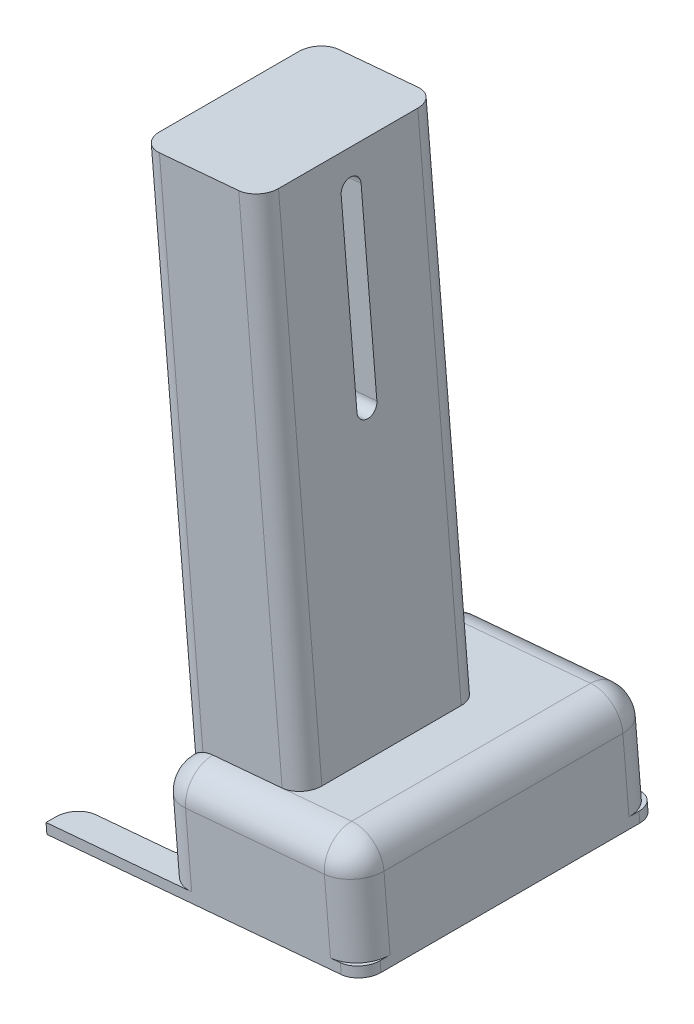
ISO-10303-21;
HEADER;
FILE_DESCRIPTION(('STEP AP214'),'2;1');
FILE_NAME('part.step','',(''),(''),'','','');
FILE_SCHEMA(('AUTOMOTIVE_DESIGN { 1 0 10303 214 1 1 1 1 }'));
ENDSEC;
DATA;
#1=APPLICATION_CONTEXT('core data for automotive mechanical design processes');
#2=APPLICATION_PROTOCOL_DEFINITION('international standard','automotive_design',2000,#1);
#3=PRODUCT_CONTEXT('',#1,'mechanical');
#4=PRODUCT('Part','Part','',(#3));
#5=PRODUCT_RELATED_PRODUCT_CATEGORY('part','',(#4));
#6=PRODUCT_DEFINITION_FORMATION('','',#4);
#7=PRODUCT_DEFINITION_CONTEXT('part definition',#1,'design');
#8=PRODUCT_DEFINITION('design','',#6,#7);
#9=PRODUCT_DEFINITION_SHAPE('','',#8);
#10=(LENGTH_UNIT() NAMED_UNIT(*) SI_UNIT(.MILLI.,.METRE.));
#11=(NAMED_UNIT(*) PLANE_ANGLE_UNIT() SI_UNIT($,.RADIAN.));
#12=(NAMED_UNIT(*) SI_UNIT($,.STERADIAN.) SOLID_ANGLE_UNIT());
#13=UNCERTAINTY_MEASURE_WITH_UNIT(LENGTH_MEASURE(1.E-05),#10,'distance_accuracy_value','');
#14=(GEOMETRIC_REPRESENTATION_CONTEXT(3) GLOBAL_UNCERTAINTY_ASSIGNED_CONTEXT((#13)) GLOBAL_UNIT_ASSIGNED_CONTEXT((#10,
#11,#12)) REPRESENTATION_CONTEXT('',''));
#15=CARTESIAN_POINT('',(0.,0.,0.));
#16=DIRECTION('',(0.,0.,1.));
#17=DIRECTION('',(1.,0.,0.));
#18=AXIS2_PLACEMENT_3D('',#15,#16,#17);
#19=CARTESIAN_POINT('',(1.81047112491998,5.17749488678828,0.));
#20=DIRECTION('',(0.996194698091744,0.0871557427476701,0.));
#21=DIRECTION('',(0.0871557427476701,-0.996194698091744,0.));
#22=AXIS2_PLACEMENT_3D('',#19,#20,#21);
#23=PLANE('',#22);
#24=DIRECTION('',(0.0871557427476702,-0.996194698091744,0.));
#25=VECTOR('',#24,1.);
#26=CARTESIAN_POINT('',(-0.36842244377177,30.0823623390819,12.6139372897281));
#27=LINE('',#26,#25);
#28=CARTESIAN_POINT('',(1.94120473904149,3.68320283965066,12.6139372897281));
#29=VERTEX_POINT('',#28);
#30=CARTESIAN_POINT('',(2.24624983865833,0.196521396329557,12.6139372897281));
#31=VERTEX_POINT('',#30);
#32=EDGE_CURVE('E492',#29,#31,#27,.T.);
#33=ORIENTED_EDGE('',*,*,#32,.T.);
#34=DIRECTION('',(0.,0.,-1.));
#35=VECTOR('',#34,1.);
#36=CARTESIAN_POINT('',(2.24624983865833,0.196521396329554,0.));
#37=LINE('',#36,#35);
#38=CARTESIAN_POINT('',(2.24624983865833,0.196521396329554,13.5));
#39=VERTEX_POINT('',#38);
#40=EDGE_CURVE('E533',#39,#31,#37,.T.);
#41=ORIENTED_EDGE('',*,*,#40,.F.);
#42=DIRECTION('',(0.0871557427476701,-0.996194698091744,0.));
#43=VECTOR('',#42,1.);
#44=CARTESIAN_POINT('',(1.81047112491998,5.17749488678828,13.5));
#45=LINE('',#44,#43);
#46=CARTESIAN_POINT('',(1.94120473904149,3.68320283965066,13.5));
#47=VERTEX_POINT('',#46);
#48=EDGE_CURVE('E566',#47,#39,#45,.T.);
#49=ORIENTED_EDGE('',*,*,#48,.F.);
#50=DIRECTION('',(0.,0.,-1.));
#51=VECTOR('',#50,1.);
#52=CARTESIAN_POINT('',(1.94120473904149,3.68320283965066,0.));
#53=LINE('',#52,#51);
#54=EDGE_CURVE('E562',#29,#47,#53,.F.);
#55=ORIENTED_EDGE('',*,*,#54,.F.);
#56=EDGE_LOOP('',(#33,#41,#49,#55));
#57=FACE_BOUND('',#56,.T.);
#58=ADVANCED_FACE('F32',(#57),#23,.F.);
#59=DIRECTION('',(0.0871557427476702,-0.996194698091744,0.));
#60=VECTOR('',#59,1.);
#61=CARTESIAN_POINT('',(-0.36842244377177,30.0823623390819,5.3844195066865));
#62=LINE('',#61,#60);
#63=CARTESIAN_POINT('',(2.24624983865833,0.196521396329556,5.3844195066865));
#64=VERTEX_POINT('',#63);
#65=CARTESIAN_POINT('',(1.94120473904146,3.68320283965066,5.38441950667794));
#66=VERTEX_POINT('',#65);
#67=EDGE_CURVE('E489',#64,#66,#62,.F.);
#68=ORIENTED_EDGE('',*,*,#67,.T.);
#69=CARTESIAN_POINT('',(1.94120473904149,3.68320283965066,1.5));
#70=VERTEX_POINT('',#69);
#71=EDGE_CURVE('E563',#70,#66,#53,.F.);
#72=ORIENTED_EDGE('',*,*,#71,.F.);
#73=DIRECTION('',(0.0871557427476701,-0.996194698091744,0.));
#74=VECTOR('',#73,1.);
#75=CARTESIAN_POINT('',(1.81047112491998,5.17749488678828,1.5));
#76=LINE('',#75,#74);
#77=CARTESIAN_POINT('',(2.24624983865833,0.196521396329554,1.5));
#78=VERTEX_POINT('',#77);
#79=EDGE_CURVE('E569',#78,#70,#76,.F.);
#80=ORIENTED_EDGE('',*,*,#79,.F.);
#81=DIRECTION('',(0.,0.,1.));
#82=VECTOR('',#81,1.);
#83=CARTESIAN_POINT('',(2.24624983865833,0.196521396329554,0.));
#84=LINE('',#83,#82);
#85=CARTESIAN_POINT('',(2.24624983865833,0.196521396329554,2.5));
#86=VERTEX_POINT('',#85);
#87=EDGE_CURVE('E399',#78,#86,#84,.T.);
#88=ORIENTED_EDGE('',*,*,#87,.T.);
#89=DIRECTION('',(-0.0871557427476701,0.996194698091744,0.));
#90=VECTOR('',#89,1.);
#91=CARTESIAN_POINT('',(2.28982771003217,-0.301575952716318,2.5));
#92=LINE('',#91,#90);
#93=CARTESIAN_POINT('',(2.28982771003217,-0.301575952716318,2.5));
#94=VERTEX_POINT('',#93);
#95=EDGE_CURVE('E409',#94,#86,#92,.T.);
#96=ORIENTED_EDGE('',*,*,#95,.F.);
#97=DIRECTION('',(0.,0.,-1.));
#98=VECTOR('',#97,1.);
#99=CARTESIAN_POINT('',(2.28982771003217,-0.301575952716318,2.5));
#100=LINE('',#99,#98);
#101=CARTESIAN_POINT('',(2.28982771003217,-0.301575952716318,12.5));
#102=VERTEX_POINT('',#101);
#103=EDGE_CURVE('E381',#102,#94,#100,.T.);
#104=ORIENTED_EDGE('',*,*,#103,.F.);
#105=DIRECTION('',(-0.0871557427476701,0.996194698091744,0.));
#106=VECTOR('',#105,1.);
#107=CARTESIAN_POINT('',(2.28982771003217,-0.301575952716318,12.5));
#108=LINE('',#107,#106);
#109=CARTESIAN_POINT('',(2.24624983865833,0.196521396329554,12.5));
#110=VERTEX_POINT('',#109);
#111=EDGE_CURVE('E412',#102,#110,#108,.T.);
#112=ORIENTED_EDGE('',*,*,#111,.T.);
#113=DIRECTION('',(0.,0.,-1.));
#114=VECTOR('',#113,1.);
#115=CARTESIAN_POINT('',(2.24624983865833,0.196521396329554,2.5));
#116=LINE('',#115,#114);
#117=EDGE_CURVE('E345',#110,#64,#116,.T.);
#118=ORIENTED_EDGE('',*,*,#117,.T.);
#119=EDGE_LOOP('',(#68,#72,#80,#88,#96,#104,#112,#118));
#120=FACE_BOUND('',#119,.T.);
#121=ADVANCED_FACE('F635',(#120),#23,.F.);
#122=CARTESIAN_POINT('',(1.81047112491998,5.17749488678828,15.));
#123=DIRECTION('',(0.0871557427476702,-0.996194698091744,0.));
#124=DIRECTION('',(-0.996194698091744,-0.0871557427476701,0.));
#125=AXIS2_PLACEMENT_3D('',#122,#123,#124);
#126=PLANE('',#125);
#127=DIRECTION('',(0.996194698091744,0.0871557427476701,0.));
#128=VECTOR('',#127,1.);
#129=CARTESIAN_POINT('',(1.81047112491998,5.17749488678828,4.49917839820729));
#130=LINE('',#129,#128);
#131=CARTESIAN_POINT('',(3.3047631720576,5.30822850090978,4.49917839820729));
#132=VERTEX_POINT('',#131);
#133=CARTESIAN_POINT('',(6.78486313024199,5.61269779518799,4.49917839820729));
#134=VERTEX_POINT('',#133);
#135=EDGE_CURVE('E486',#132,#134,#130,.T.);
#136=ORIENTED_EDGE('',*,*,#135,.T.);
#137=CARTESIAN_POINT('',(6.78486313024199,5.612697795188,5.49917839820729));
#138=DIRECTION('',(-0.0871557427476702,0.996194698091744,0.));
#139=DIRECTION('',(-0.996194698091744,-0.0871557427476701,0.));
#140=AXIS2_PLACEMENT_3D('',#137,#138,#139);
#141=CIRCLE('',#140,0.999999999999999);
#142=CARTESIAN_POINT('',(7.78105782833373,5.69985353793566,5.49917839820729));
#143=VERTEX_POINT('',#142);
#144=EDGE_CURVE('E501',#134,#143,#141,.F.);
#145=ORIENTED_EDGE('',*,*,#144,.T.);
#146=DIRECTION('',(0.,0.,1.));
#147=VECTOR('',#146,1.);
#148=CARTESIAN_POINT('',(7.78105782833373,5.69985353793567,15.));
#149=LINE('',#148,#147);
#150=CARTESIAN_POINT('',(7.78105782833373,5.69985353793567,12.4991783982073));
#151=VERTEX_POINT('',#150);
#152=EDGE_CURVE('E498',#143,#151,#149,.T.);
#153=ORIENTED_EDGE('',*,*,#152,.T.);
#154=CARTESIAN_POINT('',(6.78486313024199,5.612697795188,12.4991783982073));
#155=DIRECTION('',(-0.0871557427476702,0.996194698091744,0.));
#156=DIRECTION('',(-0.996194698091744,-0.0871557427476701,0.));
#157=AXIS2_PLACEMENT_3D('',#154,#155,#156);
#158=CIRCLE('',#157,1.);
#159=CARTESIAN_POINT('',(6.78486313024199,5.612697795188,13.4991783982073));
#160=VERTEX_POINT('',#159);
#161=EDGE_CURVE('E495',#151,#160,#158,.F.);
#162=ORIENTED_EDGE('',*,*,#161,.T.);
#163=DIRECTION('',(-0.996194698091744,-0.0871557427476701,0.));
#164=VECTOR('',#163,1.);
#165=CARTESIAN_POINT('',(1.81047112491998,5.17749488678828,13.4991783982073));
#166=LINE('',#165,#164);
#167=CARTESIAN_POINT('',(3.3047631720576,5.30822850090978,13.4991783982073));
#168=VERTEX_POINT('',#167);
#169=EDGE_CURVE('E483',#160,#168,#166,.T.);
#170=ORIENTED_EDGE('',*,*,#169,.T.);
#171=DIRECTION('',(0.,0.,-1.));
#172=VECTOR('',#171,1.);
#173=CARTESIAN_POINT('',(3.3047631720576,5.30822850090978,15.));
#174=LINE('',#173,#172);
#175=CARTESIAN_POINT('',(3.3047631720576,5.30822850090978,13.5));
#176=VERTEX_POINT('',#175);
#177=EDGE_CURVE('E591',#176,#168,#174,.T.);
#178=ORIENTED_EDGE('',*,*,#177,.F.);
#179=DIRECTION('',(-0.996194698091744,-0.0871557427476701,0.));
#180=VECTOR('',#179,1.);
#181=CARTESIAN_POINT('',(1.81047112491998,5.17749488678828,13.5));
#182=LINE('',#181,#180);
#183=CARTESIAN_POINT('',(10.2781260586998,5.91831870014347,13.5));
#184=VERTEX_POINT('',#183);
#185=EDGE_CURVE('E587',#184,#176,#182,.T.);
#186=ORIENTED_EDGE('',*,*,#185,.F.);
#187=DIRECTION('',(0.,0.,1.));
#188=VECTOR('',#187,1.);
#189=CARTESIAN_POINT('',(10.2781260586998,5.91831870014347,15.));
#190=LINE('',#189,#188);
#191=CARTESIAN_POINT('',(10.2781260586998,5.91831870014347,1.5));
#192=VERTEX_POINT('',#191);
#193=EDGE_CURVE('E584',#192,#184,#190,.T.);
#194=ORIENTED_EDGE('',*,*,#193,.F.);
#195=DIRECTION('',(0.996194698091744,0.0871557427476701,0.));
#196=VECTOR('',#195,1.);
#197=CARTESIAN_POINT('',(1.81047112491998,5.17749488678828,1.5));
#198=LINE('',#197,#196);
#199=CARTESIAN_POINT('',(3.3047631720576,5.30822850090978,1.5));
#200=VERTEX_POINT('',#199);
#201=EDGE_CURVE('E581',#200,#192,#198,.T.);
#202=ORIENTED_EDGE('',*,*,#201,.F.);
#203=EDGE_CURVE('E590',#132,#200,#174,.T.);
#204=ORIENTED_EDGE('',*,*,#203,.F.);
#205=EDGE_LOOP('',(#136,#145,#153,#162,#170,#178,#186,#194,#202,#204));
#206=FACE_BOUND('',#205,.T.);
#207=ADVANCED_FACE('F611',(#206),#126,.F.);
#208=CARTESIAN_POINT('',(3.43549678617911,3.81393645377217,15.));
#209=DIRECTION('',(0.,0.,-1.));
#210=DIRECTION('',(0.984807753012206,0.173648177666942,0.));
#211=AXIS2_PLACEMENT_3D('',#208,#209,#210);
#212=CYLINDRICAL_SURFACE('',#211,1.5);
#213=CARTESIAN_POINT('',(3.43549678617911,3.81393645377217,4.49917839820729));
#214=DIRECTION('',(0.,0.,-1.));
#215=DIRECTION('',(-0.984807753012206,-0.173648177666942,0.));
#216=AXIS2_PLACEMENT_3D('',#213,#214,#215);
#217=CIRCLE('',#216,1.5);
#218=CARTESIAN_POINT('',(2.80776621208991,5.17627060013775,4.49917839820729));
#219=VERTEX_POINT('',#218);
#220=EDGE_CURVE('E43',#132,#219,#217,.F.);
#221=ORIENTED_EDGE('',*,*,#220,.F.);
#222=ORIENTED_EDGE('',*,*,#203,.T.);
#223=CARTESIAN_POINT('',(3.43549678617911,3.81393645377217,1.5));
#224=DIRECTION('',(0.,0.,1.));
#225=DIRECTION('',(0.984807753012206,0.173648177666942,0.));
#226=AXIS2_PLACEMENT_3D('',#223,#224,#225);
#227=CIRCLE('',#226,1.5);
#228=EDGE_CURVE('E520',#200,#70,#227,.T.);
#229=ORIENTED_EDGE('',*,*,#228,.T.);
#230=ORIENTED_EDGE('',*,*,#71,.T.);
#231=CARTESIAN_POINT('',(1.94120473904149,3.68320283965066,5.61393728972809));
#232=CARTESIAN_POINT('',(1.94009975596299,3.69583787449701,5.61394442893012));
#233=CARTESIAN_POINT('',(1.93915578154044,3.70850372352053,5.61538150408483));
#234=CARTESIAN_POINT('',(1.93760724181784,3.73340289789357,5.62061730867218));
#235=CARTESIAN_POINT('',(1.93700545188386,3.74563195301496,5.62443483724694));
#236=CARTESIAN_POINT('',(1.93578313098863,3.77811431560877,5.63674583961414));
#237=CARTESIAN_POINT('',(1.9354598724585,3.79781912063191,5.64662814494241));
#238=CARTESIAN_POINT('',(1.93554021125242,3.83630334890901,5.66809443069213));
#239=CARTESIAN_POINT('',(1.93594732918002,3.85507783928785,5.6796864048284));
#240=CARTESIAN_POINT('',(1.93817093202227,3.91099851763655,5.71580096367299));
#241=CARTESIAN_POINT('',(1.94100092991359,3.9473672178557,5.74146127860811));
#242=CARTESIAN_POINT('',(1.95083436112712,4.03380437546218,5.80375648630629));
#243=CARTESIAN_POINT('',(1.95905592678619,4.08352114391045,5.84066773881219));
#244=CARTESIAN_POINT('',(1.98054251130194,4.18225658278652,5.91413275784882));
#245=CARTESIAN_POINT('',(1.99381505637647,4.23127409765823,5.95068590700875));
#246=CARTESIAN_POINT('',(2.02549179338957,4.32820116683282,6.02234582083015));
#247=CARTESIAN_POINT('',(2.04386258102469,4.37611580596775,6.05746034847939));
#248=CARTESIAN_POINT('',(2.08600342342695,4.47086319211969,6.12577339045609));
#249=CARTESIAN_POINT('',(2.1097684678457,4.51769689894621,6.15897364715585));
#250=CARTESIAN_POINT('',(2.16946589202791,4.6211199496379,6.23048265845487));
#251=CARTESIAN_POINT('',(2.2069511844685,4.6773235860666,6.26808010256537));
#252=CARTESIAN_POINT('',(2.29129636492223,4.78632608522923,6.33735391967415));
#253=CARTESIAN_POINT('',(2.33814949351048,4.83912736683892,6.3690345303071));
#254=CARTESIAN_POINT('',(2.4304771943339,4.92890594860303,6.41812593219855));
#255=CARTESIAN_POINT('',(2.47413524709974,4.96686376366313,6.43713820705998));
#256=CARTESIAN_POINT('',(2.56711885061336,5.03841392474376,6.46835351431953));
#257=CARTESIAN_POINT('',(2.61643675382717,5.07201203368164,6.48056560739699));
#258=CARTESIAN_POINT('',(2.71118271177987,5.12842680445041,6.49517291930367));
#259=CARTESIAN_POINT('',(2.75589307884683,5.15210722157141,6.49886324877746));
#260=CARTESIAN_POINT('',(2.84753511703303,5.19482398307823,6.49945419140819));
#261=CARTESIAN_POINT('',(2.89446546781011,5.21386304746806,6.49635879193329));
#262=CARTESIAN_POINT('',(2.98923081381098,5.24689603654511,6.48278223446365));
#263=CARTESIAN_POINT('',(3.0370683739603,5.26087230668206,6.47227560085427));
#264=CARTESIAN_POINT('',(3.13173008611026,5.28366342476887,6.44376111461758));
#265=CARTESIAN_POINT('',(3.17855412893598,5.29247771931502,6.42575245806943));
#266=CARTESIAN_POINT('',(3.26696917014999,5.30507209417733,6.38384348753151));
#267=CARTESIAN_POINT('',(3.30870635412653,5.30910297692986,6.36032282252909));
#268=CARTESIAN_POINT('',(3.38859225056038,5.31373738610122,6.30756721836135));
#269=CARTESIAN_POINT('',(3.42674021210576,5.31434019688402,6.27833108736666));
#270=CARTESIAN_POINT('',(3.50101541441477,5.31299672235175,6.21266468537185));
#271=CARTESIAN_POINT('',(3.53682366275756,5.31087242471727,6.17587810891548));
#272=CARTESIAN_POINT('',(3.60249365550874,5.30497678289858,6.09743696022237));
#273=CARTESIAN_POINT('',(3.63235194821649,5.30120448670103,6.05577958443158));
#274=CARTESIAN_POINT('',(3.68798596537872,5.29282700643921,5.96424548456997));
#275=CARTESIAN_POINT('',(3.71309196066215,5.28817660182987,5.9139635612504));
#276=CARTESIAN_POINT('',(3.75451211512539,5.27977383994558,5.80982868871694));
#277=CARTESIAN_POINT('',(3.77082795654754,5.27602131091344,5.75597642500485));
#278=CARTESIAN_POINT('',(3.79401274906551,5.27051158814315,5.64624935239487));
#279=CARTESIAN_POINT('',(3.80089698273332,5.26875116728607,5.59037796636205));
#280=CARTESIAN_POINT('',(3.8049421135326,5.26773000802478,5.47827076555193));
#281=CARTESIAN_POINT('',(3.8021057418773,5.26846856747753,5.42203505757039));
#282=CARTESIAN_POINT('',(3.78722980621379,5.27213250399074,5.31368798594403));
#283=CARTESIAN_POINT('',(3.77564572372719,5.27494949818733,5.26150922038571));
#284=CARTESIAN_POINT('',(3.74426385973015,5.28190070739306,5.15977238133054));
#285=CARTESIAN_POINT('',(3.7244633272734,5.28603536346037,5.11021519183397));
#286=CARTESIAN_POINT('',(3.67649883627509,5.29465548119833,5.01331122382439));
#287=CARTESIAN_POINT('',(3.6480812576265,5.29914800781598,4.96609072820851));
#288=CARTESIAN_POINT('',(3.58393482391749,5.30692280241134,4.87676811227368));
#289=CARTESIAN_POINT('',(3.54820352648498,5.31020466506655,4.83466770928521));
#290=CARTESIAN_POINT('',(3.46908055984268,5.31409954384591,4.75538878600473));
#291=CARTESIAN_POINT('',(3.42547681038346,5.31462189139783,4.71841593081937));
#292=CARTESIAN_POINT('',(3.33284498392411,5.31113445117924,4.65231436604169));
#293=CARTESIAN_POINT('',(3.28382171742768,5.30712865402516,4.62317877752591));
#294=CARTESIAN_POINT('',(3.18630957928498,5.29384472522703,4.57576338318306));
#295=CARTESIAN_POINT('',(3.13809234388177,5.28501453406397,4.556801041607));
#296=CARTESIAN_POINT('',(3.04052195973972,5.26186693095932,4.52686044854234));
#297=CARTESIAN_POINT('',(2.99116940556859,5.24755233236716,4.51587811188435));
#298=CARTESIAN_POINT('',(2.89730476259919,5.21487045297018,4.50238128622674));
#299=CARTESIAN_POINT('',(2.85272886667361,5.19693421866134,4.49924370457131));
#300=CARTESIAN_POINT('',(2.76551805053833,5.15685611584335,4.49911506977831));
#301=CARTESIAN_POINT('',(2.72288351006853,5.13471342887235,4.50212521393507));
#302=CARTESIAN_POINT('',(2.638234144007,5.08551007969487,4.51386127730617));
#303=CARTESIAN_POINT('',(2.59638100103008,5.05824655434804,4.52289106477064));
#304=CARTESIAN_POINT('',(2.51649983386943,5.00047797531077,4.54596859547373));
#305=CARTESIAN_POINT('',(2.47847380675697,4.96997124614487,4.56001894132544));
#306=CARTESIAN_POINT('',(2.38686066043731,4.8890479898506,4.60098690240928));
#307=CARTESIAN_POINT('',(2.33610607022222,4.83685149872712,4.6307421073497));
#308=CARTESIAN_POINT('',(2.244324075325,4.72836994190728,4.69714236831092));
#309=CARTESIAN_POINT('',(2.2033259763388,4.67207320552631,4.73380760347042));
#310=CARTESIAN_POINT('',(2.11605616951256,4.53377977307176,4.82746886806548));
#311=CARTESIAN_POINT('',(2.07424175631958,4.45051552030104,4.88672847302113));
#312=CARTESIAN_POINT('',(2.00729473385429,4.28140861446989,5.01022556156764));
#313=CARTESIAN_POINT('',(1.98213944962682,4.195569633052,5.07445614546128));
#314=CARTESIAN_POINT('',(1.95869742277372,4.07850620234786,5.16135004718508));
#315=CARTESIAN_POINT('',(1.95359884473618,4.04828689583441,5.1837197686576));
#316=CARTESIAN_POINT('',(1.94523200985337,3.9873221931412,5.22823927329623));
#317=CARTESIAN_POINT('',(1.94196692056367,3.95657598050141,5.25038861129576));
#318=CARTESIAN_POINT('',(1.93768787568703,3.89914944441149,5.29008849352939));
#319=CARTESIAN_POINT('',(1.93639862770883,3.8725995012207,5.30781047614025));
#320=CARTESIAN_POINT('',(1.93525148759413,3.81803307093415,5.34116598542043));
#321=CARTESIAN_POINT('',(1.9353895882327,3.79002090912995,5.35680523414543));
#322=CARTESIAN_POINT('',(1.93691689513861,3.7474568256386,5.3733334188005));
#323=CARTESIAN_POINT('',(1.93755128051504,3.73429216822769,5.37755570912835));
#324=CARTESIAN_POINT('',(1.93921839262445,3.70750733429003,5.3831817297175));
#325=CARTESIAN_POINT('',(1.94024583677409,3.69389529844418,5.38462136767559));
#326=CARTESIAN_POINT('',(1.94267897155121,3.66668550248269,5.38416833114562));
#327=CARTESIAN_POINT('',(1.94408692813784,3.6530883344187,5.3822553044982));
#328=CARTESIAN_POINT('',(1.94720004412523,3.62643321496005,5.37583452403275));
#329=CARTESIAN_POINT('',(1.94890900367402,3.61338517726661,5.37129165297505));
#330=CARTESIAN_POINT('',(1.95327424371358,3.58298897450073,5.3586499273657));
#331=CARTESIAN_POINT('',(1.95603903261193,3.56596373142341,5.34985520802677));
#332=CARTESIAN_POINT('',(1.96199673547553,3.53272092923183,5.33095074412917));
#333=CARTESIAN_POINT('',(1.96519084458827,3.51650580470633,5.32083733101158));
#334=CARTESIAN_POINT('',(1.9754378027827,3.46853397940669,5.28950122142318));
#335=CARTESIAN_POINT('',(1.98314154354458,3.43754241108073,5.26733213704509));
#336=CARTESIAN_POINT('',(2.00570528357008,3.35749393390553,5.20835382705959));
#337=CARTESIAN_POINT('',(2.02203089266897,3.30923366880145,5.17104255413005));
#338=CARTESIAN_POINT('',(2.05960766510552,3.21433014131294,5.09670048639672));
#339=CARTESIAN_POINT('',(2.08086515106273,3.16768904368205,5.05967011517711));
#340=CARTESIAN_POINT('',(2.12840477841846,3.07626649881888,4.9868853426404));
#341=CARTESIAN_POINT('',(2.1546705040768,3.03147954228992,4.95112721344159));
#342=CARTESIAN_POINT('',(2.21245563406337,2.94392615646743,4.88151380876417));
#343=CARTESIAN_POINT('',(2.2439702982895,2.90115794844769,4.84765685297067));
#344=CARTESIAN_POINT('',(2.31994952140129,2.80902153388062,4.77550780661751));
#345=CARTESIAN_POINT('',(2.3657402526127,2.76023439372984,4.73784702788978));
#346=CARTESIAN_POINT('',(2.46580500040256,2.66749066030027,4.66823351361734));
#347=CARTESIAN_POINT('',(2.52006951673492,2.62352875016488,4.63627447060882));
#348=CARTESIAN_POINT('',(2.6256267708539,2.55005351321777,4.58590576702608));
#349=CARTESIAN_POINT('',(2.67543121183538,2.51939501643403,4.56606895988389));
#350=CARTESIAN_POINT('',(2.78006989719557,2.46341057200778,4.53325200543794));
#351=CARTESIAN_POINT('',(2.8348975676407,2.43807779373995,4.5202630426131));
#352=CARTESIAN_POINT('',(2.93852115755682,2.39776337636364,4.50441101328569));
#353=CARTESIAN_POINT('',(2.98670119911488,2.38174697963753,4.50017696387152));
#354=CARTESIAN_POINT('',(3.08456482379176,2.3546840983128,4.4984945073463));
#355=CARTESIAN_POINT('',(3.13424747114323,2.34363458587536,4.50104195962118));
#356=CARTESIAN_POINT('',(3.23377064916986,2.32670290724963,4.51355880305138));
#357=CARTESIAN_POINT('',(3.28361107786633,2.32084016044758,4.52355583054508));
#358=CARTESIAN_POINT('',(3.38150256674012,2.31410550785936,4.55113260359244));
#359=CARTESIAN_POINT('',(3.42955349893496,2.31323395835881,4.56871289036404));
#360=CARTESIAN_POINT('',(3.51945690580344,2.31565238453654,4.60979543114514));
#361=CARTESIAN_POINT('',(3.56150815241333,2.31869718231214,4.63288180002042));
#362=CARTESIAN_POINT('',(3.64154553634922,2.327609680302,4.6848142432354));
#363=CARTESIAN_POINT('',(3.67953085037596,2.33347795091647,4.71366148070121));
#364=CARTESIAN_POINT('',(3.75300912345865,2.34741830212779,4.7784612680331));
#365=CARTESIAN_POINT('',(3.78817850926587,2.35560904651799,4.81475427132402));
#366=CARTESIAN_POINT('',(3.85245493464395,2.37266829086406,4.8922328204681));
#367=CARTESIAN_POINT('',(3.88155847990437,2.38153717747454,4.93342116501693));
#368=CARTESIAN_POINT('',(3.93575783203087,2.39949875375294,5.02407724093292));
#369=CARTESIAN_POINT('',(3.96018279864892,2.40852842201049,5.0739607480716));
#370=CARTESIAN_POINT('',(4.00060235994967,2.42428557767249,5.17737632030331));
#371=CARTESIAN_POINT('',(4.01659822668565,2.43101341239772,5.23090783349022));
#372=CARTESIAN_POINT('',(4.0397421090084,2.44096525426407,5.34031753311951));
#373=CARTESIAN_POINT('',(4.04686922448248,2.44418098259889,5.39620094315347));
#374=CARTESIAN_POINT('',(4.0519527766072,2.4464602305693,5.50845773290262));
#375=CARTESIAN_POINT('',(4.04991206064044,2.44552503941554,5.56483095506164));
#376=CARTESIAN_POINT('',(4.03707511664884,2.43983805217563,5.67348896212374));
#377=CARTESIAN_POINT('',(4.0267213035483,2.43527922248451,5.72583731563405));
#378=CARTESIAN_POINT('',(3.99811688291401,2.42336227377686,5.8279989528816));
#379=CARTESIAN_POINT('',(3.97986369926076,2.41600324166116,5.87781140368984));
#380=CARTESIAN_POINT('',(3.93522051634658,2.39941965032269,5.9751683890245));
#381=CARTESIAN_POINT('',(3.90860247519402,2.39014567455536,6.02259978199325));
#382=CARTESIAN_POINT('',(3.84794863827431,2.37140766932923,6.11244112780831));
#383=CARTESIAN_POINT('',(3.81391023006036,2.36194357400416,6.15484930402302));
#384=CARTESIAN_POINT('',(3.73770922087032,2.34415759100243,6.23497585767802));
#385=CARTESIAN_POINT('',(3.69530051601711,2.33588836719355,6.27247350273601));
#386=CARTESIAN_POINT('',(3.60425433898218,2.32275311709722,6.33969645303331));
#387=CARTESIAN_POINT('',(3.55562214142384,2.31788423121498,6.36942827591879));
#388=CARTESIAN_POINT('',(3.45764250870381,2.31336149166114,6.41811682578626));
#389=CARTESIAN_POINT('',(3.40863752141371,2.3133354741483,6.43772622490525));
#390=CARTESIAN_POINT('',(3.30840764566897,2.31849005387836,6.46890855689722));
#391=CARTESIAN_POINT('',(3.25718401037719,2.32366774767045,6.48048596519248));
#392=CARTESIAN_POINT('',(3.15884196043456,2.33890192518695,6.49501410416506));
#393=CARTESIAN_POINT('',(3.11174624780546,2.34850436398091,6.49861669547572));
#394=CARTESIAN_POINT('',(3.01865252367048,2.37221884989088,6.49961841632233));
#395=CARTESIAN_POINT('',(2.97265472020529,2.38633174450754,6.49701637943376));
#396=CARTESIAN_POINT('',(2.88059958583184,2.41944753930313,6.48607865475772));
#397=CARTESIAN_POINT('',(2.83465065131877,2.43865685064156,6.4774671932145));
#398=CARTESIAN_POINT('',(2.74588922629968,2.48094552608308,6.45520051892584));
#399=CARTESIAN_POINT('',(2.70307839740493,2.50402691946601,6.44154265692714));
#400=CARTESIAN_POINT('',(2.59889804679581,2.56672946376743,6.40165535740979));
#401=CARTESIAN_POINT('',(2.53993168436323,2.60856931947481,6.37261532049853));
#402=CARTESIAN_POINT('',(2.43072022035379,2.69794586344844,6.30764726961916));
#403=CARTESIAN_POINT('',(2.38049973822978,2.74549801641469,6.27170039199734));
#404=CARTESIAN_POINT('',(2.27020394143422,2.864691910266,6.17969137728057));
#405=CARTESIAN_POINT('',(2.21421851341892,2.93836273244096,6.12133365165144));
#406=CARTESIAN_POINT('',(2.14206992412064,3.05296033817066,6.03009357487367));
#407=CARTESIAN_POINT('',(2.11998834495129,3.09185065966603,5.99905555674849));
#408=CARTESIAN_POINT('',(2.07958776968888,3.17091098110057,5.93613348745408));
#409=CARTESIAN_POINT('',(2.06126873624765,3.21108096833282,5.9042494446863));
#410=CARTESIAN_POINT('',(2.03169385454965,3.28426082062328,5.84684540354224));
#411=CARTESIAN_POINT('',(2.01976055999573,3.31703750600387,5.82136997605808));
#412=CARTESIAN_POINT('',(1.99814399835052,3.38353659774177,5.77071876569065));
#413=CARTESIAN_POINT('',(1.98845928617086,3.41725838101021,5.74554280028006));
#414=CARTESIAN_POINT('',(1.97505984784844,3.47112700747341,5.7075502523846));
#415=CARTESIAN_POINT('',(1.97059600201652,3.49070119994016,5.69418000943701));
#416=CARTESIAN_POINT('',(1.96232417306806,3.53076860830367,5.66853132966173));
#417=CARTESIAN_POINT('',(1.95851694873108,3.55126285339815,5.65625416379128));
#418=CARTESIAN_POINT('',(1.95303197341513,3.58490830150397,5.63913816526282));
#419=CARTESIAN_POINT('',(1.95113202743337,3.59752295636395,5.63334251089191));
#420=CARTESIAN_POINT('',(1.94758266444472,3.62346142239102,5.62356181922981));
#421=CARTESIAN_POINT('',(1.94593200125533,3.63678122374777,5.61956756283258));
#422=CARTESIAN_POINT('',(1.94384617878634,3.65579685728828,5.61602445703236));
#423=CARTESIAN_POINT('',(1.94327808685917,3.66124870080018,5.61524728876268));
#424=CARTESIAN_POINT('',(1.94219810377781,3.67219940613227,5.61420247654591));
#425=CARTESIAN_POINT('',(1.94168614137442,3.677698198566,5.61393417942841));
#426=CARTESIAN_POINT('',(1.94120473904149,3.68320283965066,5.61393728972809));
#427=B_SPLINE_CURVE_WITH_KNOTS('',3,(#231,#232,#233,#234,#235,#236,#237,#238,#239,#240,#241,
#242,#243,#244,#245,#246,#247,#248,#249,#250,#251,#252,#253,#254,#255,#256,#257,#258,#259,#260,
#261,#262,#263,#264,#265,#266,#267,#268,#269,#270,#271,#272,#273,#274,#275,#276,#277,#278,#279,
#280,#281,#282,#283,#284,#285,#286,#287,#288,#289,#290,#291,#292,#293,#294,#295,#296,#297,#298,
#299,#300,#301,#302,#303,#304,#305,#306,#307,#308,#309,#310,#311,#312,#313,#314,#315,#316,#317,
#318,#319,#320,#321,#322,#323,#324,#325,#326,#327,#328,#329,#330,#331,#332,#333,#334,#335,#336,
#337,#338,#339,#340,#341,#342,#343,#344,#345,#346,#347,#348,#349,#350,#351,#352,#353,#354,#355,
#356,#357,#358,#359,#360,#361,#362,#363,#364,#365,#366,#367,#368,#369,#370,#371,#372,#373,#374,
#375,#376,#377,#378,#379,#380,#381,#382,#383,#384,#385,#386,#387,#388,#389,#390,#391,#392,#393,
#394,#395,#396,#397,#398,#399,#400,#401,#402,#403,#404,#405,#406,#407,#408,#409,#410,#411,#412,
#413,#414,#415,#416,#417,#418,#419,#420,#421,#422,#423,#424,#425,#426),.UNSPECIFIED.,.T.,.F.,(4,
2,2,2,2,2,2,2,2,2,2,2,2,2,2,2,2,2,2,2,2,2,2,2,2,2,2,2,2,2,2,2,2,2,2,2,2,2,2,2,2,2,2,2,2,2,2,2,2,
2,2,2,2,2,2,2,2,2,2,2,2,2,2,2,2,2,2,2,2,2,2,2,2,2,2,2,2,2,2,2,2,2,2,2,2,2,2,2,2,2,2,2,2,2,2,2,2,
4),(0.,0.0380226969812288,0.0763495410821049,0.142217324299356,0.20840346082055,
0.342045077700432,0.529252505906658,0.71673998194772,0.903026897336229,1.08914148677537,
1.32035055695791,1.55139339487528,1.733417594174,1.91519867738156,2.06674014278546,
2.21819258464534,2.37016818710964,2.52216007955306,2.66577057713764,2.80941105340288,
2.96292205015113,3.11652184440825,3.28490832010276,3.4532625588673,3.62134367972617,
3.78937757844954,3.94921831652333,4.10911261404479,4.27426507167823,4.4394727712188,
4.61007634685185,4.78052968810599,4.93733187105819,5.09405372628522,5.2378638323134,
5.38170194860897,5.53341393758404,5.68520468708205,5.91983059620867,6.15515260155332,
6.48466359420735,6.81372515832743,6.92753287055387,7.04153659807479,7.13742248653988,
7.23303925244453,7.2743702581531,7.31516426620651,7.3562067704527,7.39781040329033,
7.45574759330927,7.51384954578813,7.63036690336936,7.81960264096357,8.00908233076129,
8.19795131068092,8.38665064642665,8.616287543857,8.84566881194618,9.0302654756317,
9.21462391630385,9.36682726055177,9.51893769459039,9.67161525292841,9.82430370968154,
9.96788264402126,10.1114905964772,10.2644539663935,10.4175052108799,10.5855329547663,
10.7535353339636,10.9219328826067,11.0902781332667,11.2502148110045,11.4102036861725,
11.5750005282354,11.7398554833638,11.9105798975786,12.0811605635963,12.2386266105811,
12.3960048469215,12.5399529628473,12.6839281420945,12.8349862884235,12.9861238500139,
13.218553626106,13.4516274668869,13.777904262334,13.9411162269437,14.1043265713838,
14.2338546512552,14.3632992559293,14.4356511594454,14.5080861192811,14.5500585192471,
14.5918136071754,14.6084000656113,14.6249652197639),.UNSPECIFIED.);
#428=EDGE_CURVE('E11',#219,#66,#427,.T.);
#429=ORIENTED_EDGE('',*,*,#428,.F.);
#430=EDGE_LOOP('',(#221,#222,#229,#230,#429));
#431=FACE_BOUND('',#430,.T.);
#432=ADVANCED_FACE('F605',(#431),#212,.T.);
#433=ORIENTED_EDGE('',*,*,#54,.T.);
#434=CARTESIAN_POINT('',(3.43549678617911,3.81393645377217,13.5));
#435=DIRECTION('',(0.,0.,-1.));
#436=DIRECTION('',(-0.984807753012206,-0.173648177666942,0.));
#437=AXIS2_PLACEMENT_3D('',#434,#435,#436);
#438=CIRCLE('',#437,1.5);
#439=EDGE_CURVE('E528',#176,#47,#438,.F.);
#440=ORIENTED_EDGE('',*,*,#439,.F.);
#441=ORIENTED_EDGE('',*,*,#177,.T.);
#442=CARTESIAN_POINT('',(3.43549678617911,3.81393645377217,13.4991783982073));
#443=DIRECTION('',(0.,0.,1.));
#444=DIRECTION('',(0.984807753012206,0.173648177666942,0.));
#445=AXIS2_PLACEMENT_3D('',#442,#443,#444);
#446=CIRCLE('',#445,1.5);
#447=CARTESIAN_POINT('',(2.80776621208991,5.17627060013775,13.4991783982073));
#448=VERTEX_POINT('',#447);
#449=EDGE_CURVE('E594',#448,#168,#446,.F.);
#450=ORIENTED_EDGE('',*,*,#449,.F.);
#451=CARTESIAN_POINT('',(1.94120473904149,3.68320283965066,12.6139372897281));
#452=CARTESIAN_POINT('',(1.94009975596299,3.69583787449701,12.6139444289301));
#453=CARTESIAN_POINT('',(1.93915578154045,3.70850372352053,12.6153815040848));
#454=CARTESIAN_POINT('',(1.93760724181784,3.73340289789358,12.6206173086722));
#455=CARTESIAN_POINT('',(1.93700545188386,3.74563195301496,12.6244348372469));
#456=CARTESIAN_POINT('',(1.93578313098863,3.77811431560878,12.6367458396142));
#457=CARTESIAN_POINT('',(1.9354598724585,3.79781912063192,12.6466281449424));
#458=CARTESIAN_POINT('',(1.93554021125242,3.83630334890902,12.6680944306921));
#459=CARTESIAN_POINT('',(1.93594732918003,3.85507783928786,12.6796864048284));
#460=CARTESIAN_POINT('',(1.93817093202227,3.91099851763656,12.715800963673));
#461=CARTESIAN_POINT('',(1.9410009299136,3.94736721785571,12.7414612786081));
#462=CARTESIAN_POINT('',(1.95083436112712,4.03380437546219,12.8037564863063));
#463=CARTESIAN_POINT('',(1.95905592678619,4.08352114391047,12.8406677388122));
#464=CARTESIAN_POINT('',(1.98054251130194,4.18225658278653,12.9141327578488));
#465=CARTESIAN_POINT('',(1.99381505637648,4.23127409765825,12.9506859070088));
#466=CARTESIAN_POINT('',(2.02549179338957,4.32820116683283,13.0223458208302));
#467=CARTESIAN_POINT('',(2.0438625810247,4.37611580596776,13.0574603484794));
#468=CARTESIAN_POINT('',(2.08600342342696,4.4708631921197,13.1257733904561));
#469=CARTESIAN_POINT('',(2.10976846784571,4.51769689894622,13.1589736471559));
#470=CARTESIAN_POINT('',(2.16946589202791,4.62111994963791,13.2304826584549));
#471=CARTESIAN_POINT('',(2.2069511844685,4.67732358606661,13.2680801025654));
#472=CARTESIAN_POINT('',(2.29129636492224,4.78632608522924,13.3373539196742));
#473=CARTESIAN_POINT('',(2.33814949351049,4.83912736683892,13.3690345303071));
#474=CARTESIAN_POINT('',(2.43047719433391,4.92890594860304,13.4181259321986));
#475=CARTESIAN_POINT('',(2.47413524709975,4.96686376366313,13.43713820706));
#476=CARTESIAN_POINT('',(2.56711885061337,5.03841392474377,13.4683535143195));
#477=CARTESIAN_POINT('',(2.61643675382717,5.07201203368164,13.480565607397));
#478=CARTESIAN_POINT('',(2.71118271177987,5.12842680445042,13.4951729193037));
#479=CARTESIAN_POINT('',(2.75589307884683,5.15210722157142,13.4988632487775));
#480=CARTESIAN_POINT('',(2.84753511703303,5.19482398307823,13.4994541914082));
#481=CARTESIAN_POINT('',(2.89446546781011,5.21386304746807,13.4963587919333));
#482=CARTESIAN_POINT('',(2.98923081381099,5.24689603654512,13.4827822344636));
#483=CARTESIAN_POINT('',(3.0370683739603,5.26087230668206,13.4722756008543));
#484=CARTESIAN_POINT('',(3.13173008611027,5.28366342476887,13.4437611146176));
#485=CARTESIAN_POINT('',(3.17855412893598,5.29247771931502,13.4257524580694));
#486=CARTESIAN_POINT('',(3.26696917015,5.30507209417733,13.3838434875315));
#487=CARTESIAN_POINT('',(3.30870635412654,5.30910297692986,13.3603228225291));
#488=CARTESIAN_POINT('',(3.38859225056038,5.31373738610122,13.3075672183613));
#489=CARTESIAN_POINT('',(3.42674021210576,5.31434019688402,13.2783310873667));
#490=CARTESIAN_POINT('',(3.50101541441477,5.31299672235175,13.2126646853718));
#491=CARTESIAN_POINT('',(3.53682366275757,5.31087242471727,13.1758781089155));
#492=CARTESIAN_POINT('',(3.60249365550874,5.30497678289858,13.0974369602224));
#493=CARTESIAN_POINT('',(3.63235194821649,5.30120448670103,13.0557795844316));
#494=CARTESIAN_POINT('',(3.68798596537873,5.29282700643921,12.96424548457));
#495=CARTESIAN_POINT('',(3.71309196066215,5.28817660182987,12.9139635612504));
#496=CARTESIAN_POINT('',(3.75451211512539,5.27977383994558,12.8098286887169));
#497=CARTESIAN_POINT('',(3.77082795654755,5.27602131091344,12.7559764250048));
#498=CARTESIAN_POINT('',(3.79401274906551,5.27051158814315,12.6462493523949));
#499=CARTESIAN_POINT('',(3.80089698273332,5.26875116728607,12.590377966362));
#500=CARTESIAN_POINT('',(3.8049421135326,5.26773000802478,12.4782707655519));
#501=CARTESIAN_POINT('',(3.8021057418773,5.26846856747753,12.4220350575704));
#502=CARTESIAN_POINT('',(3.78722980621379,5.27213250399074,12.313687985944));
#503=CARTESIAN_POINT('',(3.77564572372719,5.27494949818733,12.2615092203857));
#504=CARTESIAN_POINT('',(3.74426385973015,5.28190070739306,12.1597723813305));
#505=CARTESIAN_POINT('',(3.7244633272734,5.28603536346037,12.110215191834));
#506=CARTESIAN_POINT('',(3.67649883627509,5.29465548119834,12.0133112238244));
#507=CARTESIAN_POINT('',(3.64808125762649,5.29914800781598,11.9660907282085));
#508=CARTESIAN_POINT('',(3.58393482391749,5.30692280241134,11.8767681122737));
#509=CARTESIAN_POINT('',(3.54820352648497,5.31020466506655,11.8346677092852));
#510=CARTESIAN_POINT('',(3.46908055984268,5.31409954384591,11.7553887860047));
#511=CARTESIAN_POINT('',(3.42547681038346,5.31462189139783,11.7184159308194));
#512=CARTESIAN_POINT('',(3.33284498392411,5.31113445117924,11.6523143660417));
#513=CARTESIAN_POINT('',(3.28382171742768,5.30712865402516,11.6231787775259));
#514=CARTESIAN_POINT('',(3.18630957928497,5.29384472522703,11.5757633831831));
#515=CARTESIAN_POINT('',(3.13809234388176,5.28501453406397,11.556801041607));
#516=CARTESIAN_POINT('',(3.04052195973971,5.26186693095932,11.5268604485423));
#517=CARTESIAN_POINT('',(2.99116940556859,5.24755233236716,11.5158781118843));
#518=CARTESIAN_POINT('',(2.89730476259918,5.21487045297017,11.5023812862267));
#519=CARTESIAN_POINT('',(2.85272886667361,5.19693421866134,11.4992437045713));
#520=CARTESIAN_POINT('',(2.76551805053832,5.15685611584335,11.4991150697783));
#521=CARTESIAN_POINT('',(2.72288351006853,5.13471342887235,11.5021252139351));
#522=CARTESIAN_POINT('',(2.63823414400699,5.08551007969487,11.5138612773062));
#523=CARTESIAN_POINT('',(2.59638100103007,5.05824655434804,11.5228910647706));
#524=CARTESIAN_POINT('',(2.51649983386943,5.00047797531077,11.5459685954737));
#525=CARTESIAN_POINT('',(2.47847380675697,4.96997124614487,11.5600189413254));
#526=CARTESIAN_POINT('',(2.38686066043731,4.8890479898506,11.6009869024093));
#527=CARTESIAN_POINT('',(2.33610607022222,4.83685149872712,11.6307421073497));
#528=CARTESIAN_POINT('',(2.24432407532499,4.72836994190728,11.6971423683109));
#529=CARTESIAN_POINT('',(2.2033259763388,4.6720732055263,11.7338076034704));
#530=CARTESIAN_POINT('',(2.11605616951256,4.53377977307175,11.8274688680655));
#531=CARTESIAN_POINT('',(2.07424175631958,4.45051552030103,11.8867284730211));
#532=CARTESIAN_POINT('',(2.00729473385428,4.28140861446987,12.0102255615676));
#533=CARTESIAN_POINT('',(1.98213944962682,4.19556963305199,12.0744561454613));
#534=CARTESIAN_POINT('',(1.95869742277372,4.07850620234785,12.1613500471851));
#535=CARTESIAN_POINT('',(1.95359884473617,4.0482868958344,12.1837197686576));
#536=CARTESIAN_POINT('',(1.94523200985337,3.98732219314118,12.2282392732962));
#537=CARTESIAN_POINT('',(1.94196692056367,3.95657598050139,12.2503886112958));
#538=CARTESIAN_POINT('',(1.93768787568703,3.89914944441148,12.2900884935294));
#539=CARTESIAN_POINT('',(1.93639862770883,3.8725995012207,12.3078104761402));
#540=CARTESIAN_POINT('',(1.93525148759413,3.81803307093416,12.3411659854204));
#541=CARTESIAN_POINT('',(1.9353895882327,3.79002090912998,12.3568052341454));
#542=CARTESIAN_POINT('',(1.9369168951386,3.74745682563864,12.3733334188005));
#543=CARTESIAN_POINT('',(1.93755128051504,3.73429216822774,12.3775557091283));
#544=CARTESIAN_POINT('',(1.93921839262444,3.70750733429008,12.3831817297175));
#545=CARTESIAN_POINT('',(1.94024583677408,3.69389529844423,12.3846213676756));
#546=CARTESIAN_POINT('',(1.9426789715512,3.66668550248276,12.3841683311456));
#547=CARTESIAN_POINT('',(1.94408692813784,3.65308833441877,12.3822553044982));
#548=CARTESIAN_POINT('',(1.94720004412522,3.62643321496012,12.3758345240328));
#549=CARTESIAN_POINT('',(1.94890900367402,3.61338517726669,12.3712916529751));
#550=CARTESIAN_POINT('',(1.95327424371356,3.58298897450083,12.3586499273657));
#551=CARTESIAN_POINT('',(1.95603903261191,3.56596373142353,12.3498552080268));
#552=CARTESIAN_POINT('',(1.9619967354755,3.53272092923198,12.3309507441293));
#553=CARTESIAN_POINT('',(1.96519084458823,3.51650580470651,12.3208373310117));
#554=CARTESIAN_POINT('',(1.97543780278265,3.46853397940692,12.2895012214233));
#555=CARTESIAN_POINT('',(1.98314154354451,3.43754241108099,12.2673321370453));
#556=CARTESIAN_POINT('',(2.00570528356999,3.35749393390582,12.2083538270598));
#557=CARTESIAN_POINT('',(2.02203089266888,3.30923366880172,12.1710425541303));
#558=CARTESIAN_POINT('',(2.05960766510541,3.21433014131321,12.0967004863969));
#559=CARTESIAN_POINT('',(2.08086515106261,3.16768904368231,12.0596701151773));
#560=CARTESIAN_POINT('',(2.12840477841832,3.07626649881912,11.9868853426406));
#561=CARTESIAN_POINT('',(2.15467050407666,3.03147954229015,11.9511272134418));
#562=CARTESIAN_POINT('',(2.21245563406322,2.94392615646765,11.8815138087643));
#563=CARTESIAN_POINT('',(2.24397029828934,2.90115794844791,11.8476568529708));
#564=CARTESIAN_POINT('',(2.31994952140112,2.80902153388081,11.7755078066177));
#565=CARTESIAN_POINT('',(2.36574025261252,2.76023439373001,11.7378470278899));
#566=CARTESIAN_POINT('',(2.46580500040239,2.66749066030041,11.6682335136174));
#567=CARTESIAN_POINT('',(2.52006951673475,2.62352875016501,11.6362744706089));
#568=CARTESIAN_POINT('',(2.62562677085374,2.55005351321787,11.5859057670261));
#569=CARTESIAN_POINT('',(2.67543121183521,2.51939501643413,11.566068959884));
#570=CARTESIAN_POINT('',(2.7800698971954,2.46341057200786,11.533252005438));
#571=CARTESIAN_POINT('',(2.83489756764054,2.43807779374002,11.5202630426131));
#572=CARTESIAN_POINT('',(2.93852115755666,2.3977633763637,11.5044110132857));
#573=CARTESIAN_POINT('',(2.98670119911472,2.38174697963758,11.5001769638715));
#574=CARTESIAN_POINT('',(3.08456482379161,2.35468409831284,11.4984945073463));
#575=CARTESIAN_POINT('',(3.13424747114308,2.34363458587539,11.5010419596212));
#576=CARTESIAN_POINT('',(3.23377064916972,2.32670290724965,11.5135588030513));
#577=CARTESIAN_POINT('',(3.28361107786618,2.32084016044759,11.523555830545));
#578=CARTESIAN_POINT('',(3.38150256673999,2.31410550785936,11.5511326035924));
#579=CARTESIAN_POINT('',(3.42955349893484,2.31323395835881,11.568712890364));
#580=CARTESIAN_POINT('',(3.51945690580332,2.31565238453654,11.6097954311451));
#581=CARTESIAN_POINT('',(3.56150815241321,2.31869718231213,11.6328818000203));
#582=CARTESIAN_POINT('',(3.64154553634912,2.32760968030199,11.6848142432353));
#583=CARTESIAN_POINT('',(3.67953085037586,2.33347795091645,11.7136614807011));
#584=CARTESIAN_POINT('',(3.75300912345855,2.34741830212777,11.778461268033));
#585=CARTESIAN_POINT('',(3.78817850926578,2.35560904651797,11.8147542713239));
#586=CARTESIAN_POINT('',(3.85245493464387,2.37266829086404,11.892232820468));
#587=CARTESIAN_POINT('',(3.88155847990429,2.38153717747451,11.9334211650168));
#588=CARTESIAN_POINT('',(3.93575783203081,2.39949875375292,12.0240772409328));
#589=CARTESIAN_POINT('',(3.96018279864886,2.40852842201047,12.0739607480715));
#590=CARTESIAN_POINT('',(4.00060235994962,2.42428557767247,12.1773763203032));
#591=CARTESIAN_POINT('',(4.01659822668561,2.43101341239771,12.2309078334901));
#592=CARTESIAN_POINT('',(4.03974210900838,2.44096525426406,12.3403175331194));
#593=CARTESIAN_POINT('',(4.04686922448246,2.44418098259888,12.3962009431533));
#594=CARTESIAN_POINT('',(4.0519527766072,2.4464602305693,12.5084577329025));
#595=CARTESIAN_POINT('',(4.04991206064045,2.44552503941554,12.5648309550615));
#596=CARTESIAN_POINT('',(4.03707511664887,2.43983805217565,12.6734889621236));
#597=CARTESIAN_POINT('',(4.02672130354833,2.43527922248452,12.7258373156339));
#598=CARTESIAN_POINT('',(3.99811688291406,2.42336227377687,12.8279989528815));
#599=CARTESIAN_POINT('',(3.97986369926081,2.41600324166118,12.8778114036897));
#600=CARTESIAN_POINT('',(3.93522051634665,2.39941965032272,12.9751683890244));
#601=CARTESIAN_POINT('',(3.9086024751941,2.39014567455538,13.0225997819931));
#602=CARTESIAN_POINT('',(3.84794863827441,2.37140766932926,13.1124411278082));
#603=CARTESIAN_POINT('',(3.81391023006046,2.36194357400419,13.1548493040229));
#604=CARTESIAN_POINT('',(3.73770922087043,2.34415759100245,13.2349758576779));
#605=CARTESIAN_POINT('',(3.69530051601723,2.33588836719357,13.2724735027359));
#606=CARTESIAN_POINT('',(3.60425433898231,2.32275311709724,13.3396964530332));
#607=CARTESIAN_POINT('',(3.55562214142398,2.31788423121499,13.3694282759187));
#608=CARTESIAN_POINT('',(3.45764250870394,2.31336149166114,13.4181168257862));
#609=CARTESIAN_POINT('',(3.40863752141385,2.31333547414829,13.4377262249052));
#610=CARTESIAN_POINT('',(3.30840764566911,2.31849005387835,13.4689085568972));
#611=CARTESIAN_POINT('',(3.25718401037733,2.32366774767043,13.4804859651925));
#612=CARTESIAN_POINT('',(3.15884196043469,2.33890192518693,13.495014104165));
#613=CARTESIAN_POINT('',(3.11174624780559,2.34850436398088,13.4986166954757));
#614=CARTESIAN_POINT('',(3.0186525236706,2.37221884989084,13.4996184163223));
#615=CARTESIAN_POINT('',(2.97265472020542,2.3863317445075,13.4970163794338));
#616=CARTESIAN_POINT('',(2.88059958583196,2.41944753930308,13.4860786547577));
#617=CARTESIAN_POINT('',(2.8346506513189,2.4386568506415,13.4774671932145));
#618=CARTESIAN_POINT('',(2.7458892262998,2.48094552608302,13.4552005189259));
#619=CARTESIAN_POINT('',(2.70307839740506,2.50402691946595,13.4415426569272));
#620=CARTESIAN_POINT('',(2.59889804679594,2.56672946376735,13.4016553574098));
#621=CARTESIAN_POINT('',(2.53993168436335,2.60856931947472,13.3726153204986));
#622=CARTESIAN_POINT('',(2.43072022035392,2.69794586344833,13.3076472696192));
#623=CARTESIAN_POINT('',(2.3804997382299,2.74549801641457,13.2717003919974));
#624=CARTESIAN_POINT('',(2.27020394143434,2.86469191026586,13.1796913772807));
#625=CARTESIAN_POINT('',(2.21421851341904,2.9383627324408,13.1213336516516));
#626=CARTESIAN_POINT('',(2.14206992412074,3.05296033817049,13.0300935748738));
#627=CARTESIAN_POINT('',(2.11998834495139,3.09185065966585,12.9990555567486));
#628=CARTESIAN_POINT('',(2.07958776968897,3.17091098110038,12.9361334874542));
#629=CARTESIAN_POINT('',(2.06126873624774,3.21108096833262,12.9042494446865));
#630=CARTESIAN_POINT('',(2.03169385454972,3.28426082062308,12.8468454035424));
#631=CARTESIAN_POINT('',(2.01976055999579,3.31703750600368,12.8213699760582));
#632=CARTESIAN_POINT('',(1.99814399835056,3.38353659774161,12.7707187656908));
#633=CARTESIAN_POINT('',(1.9884592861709,3.41725838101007,12.7455428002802));
#634=CARTESIAN_POINT('',(1.97505984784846,3.47112700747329,12.7075502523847));
#635=CARTESIAN_POINT('',(1.97059600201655,3.49070119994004,12.6941800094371));
#636=CARTESIAN_POINT('',(1.96232417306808,3.53076860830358,12.6685313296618));
#637=CARTESIAN_POINT('',(1.9585169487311,3.55126285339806,12.6562541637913));
#638=CARTESIAN_POINT('',(1.95303197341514,3.58490830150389,12.6391381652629));
#639=CARTESIAN_POINT('',(1.95113202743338,3.59752295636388,12.6333425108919));
#640=CARTESIAN_POINT('',(1.94758266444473,3.62346142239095,12.6235618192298));
#641=CARTESIAN_POINT('',(1.94593200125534,3.63678122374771,12.6195675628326));
#642=CARTESIAN_POINT('',(1.94384617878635,3.65579685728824,12.6160244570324));
#643=CARTESIAN_POINT('',(1.94327808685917,3.66124870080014,12.6152472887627));
#644=CARTESIAN_POINT('',(1.94219810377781,3.67219940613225,12.6142024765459));
#645=CARTESIAN_POINT('',(1.94168614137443,3.67769819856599,12.6139341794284));
#646=CARTESIAN_POINT('',(1.94120473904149,3.68320283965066,12.6139372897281));
#647=B_SPLINE_CURVE_WITH_KNOTS('',3,(#451,#452,#453,#454,#455,#456,#457,#458,#459,#460,#461,
#462,#463,#464,#465,#466,#467,#468,#469,#470,#471,#472,#473,#474,#475,#476,#477,#478,#479,#480,
#481,#482,#483,#484,#485,#486,#487,#488,#489,#490,#491,#492,#493,#494,#495,#496,#497,#498,#499,
#500,#501,#502,#503,#504,#505,#506,#507,#508,#509,#510,#511,#512,#513,#514,#515,#516,#517,#518,
#519,#520,#521,#522,#523,#524,#525,#526,#527,#528,#529,#530,#531,#532,#533,#534,#535,#536,#537,
#538,#539,#540,#541,#542,#543,#544,#545,#546,#547,#548,#549,#550,#551,#552,#553,#554,#555,#556,
#557,#558,#559,#560,#561,#562,#563,#564,#565,#566,#567,#568,#569,#570,#571,#572,#573,#574,#575,
#576,#577,#578,#579,#580,#581,#582,#583,#584,#585,#586,#587,#588,#589,#590,#591,#592,#593,#594,
#595,#596,#597,#598,#599,#600,#601,#602,#603,#604,#605,#606,#607,#608,#609,#610,#611,#612,#613,
#614,#615,#616,#617,#618,#619,#620,#621,#622,#623,#624,#625,#626,#627,#628,#629,#630,#631,#632,
#633,#634,#635,#636,#637,#638,#639,#640,#641,#642,#643,#644,#645,#646),.UNSPECIFIED.,.T.,.F.,(4,
2,2,2,2,2,2,2,2,2,2,2,2,2,2,2,2,2,2,2,2,2,2,2,2,2,2,2,2,2,2,2,2,2,2,2,2,2,2,2,2,2,2,2,2,2,2,2,2,
2,2,2,2,2,2,2,2,2,2,2,2,2,2,2,2,2,2,2,2,2,2,2,2,2,2,2,2,2,2,2,2,2,2,2,2,2,2,2,2,2,2,2,2,2,2,2,2,
4),(0.,0.0380226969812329,0.0763495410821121,0.142217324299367,0.208403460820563,
0.34204507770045,0.529252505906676,0.716739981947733,0.903026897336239,1.08914148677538,
1.32035055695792,1.55139339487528,1.733417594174,1.91519867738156,2.06674014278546,
2.21819258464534,2.37016818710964,2.52216007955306,2.66577057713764,2.80941105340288,
2.96292205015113,3.11652184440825,3.28490832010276,3.45326255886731,3.62134367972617,
3.78937757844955,3.94921831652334,4.1091126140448,4.27426507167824,4.4394727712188,
4.61007634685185,4.78052968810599,4.9373318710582,5.09405372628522,5.23786383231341,
5.38170194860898,5.53341393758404,5.68520468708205,5.91983059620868,6.15515260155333,
6.48466359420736,6.81372515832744,6.92753287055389,7.04153659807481,7.13742248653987,
7.23303925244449,7.27437025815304,7.31516426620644,7.35620677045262,7.39781040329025,
7.45574759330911,7.5138495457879,7.63036690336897,7.8196026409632,8.00908233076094,
8.19795131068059,8.38665064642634,8.61628754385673,8.84566881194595,9.0302654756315,
9.21462391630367,9.3668272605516,9.51893769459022,9.67161525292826,9.82430370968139,
9.96788264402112,10.1114905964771,10.2644539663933,10.4175052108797,10.5855329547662,
10.7535353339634,10.9219328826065,11.0902781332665,11.2502148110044,11.4102036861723,
11.5750005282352,11.7398554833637,11.9105798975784,12.0811605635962,12.2386266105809,
12.3960048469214,12.5399529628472,12.6839281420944,12.8349862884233,12.9861238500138,
13.2185536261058,13.4516274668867,13.7779042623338,13.9411162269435,14.1043265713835,
14.233854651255,14.3632992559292,14.4356511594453,14.508086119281,14.550058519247,
14.5918136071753,14.6084000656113,14.6249652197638),.UNSPECIFIED.);
#648=EDGE_CURVE('E596',#29,#448,#647,.T.);
#649=ORIENTED_EDGE('',*,*,#648,.F.);
#650=EDGE_LOOP('',(#433,#440,#441,#450,#649));
#651=FACE_BOUND('',#650,.T.);
#652=ADVANCED_FACE('F610',(#651),#212,.T.);
#653=CARTESIAN_POINT('',(1.81047112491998,5.17749488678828,0.));
#654=DIRECTION('',(0.,0.,1.));
#655=DIRECTION('',(-0.984807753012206,-0.173648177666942,0.));
#656=AXIS2_PLACEMENT_3D('',#653,#654,#655);
#657=PLANE('',#656);
#658=DIRECTION('',(0.0871557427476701,-0.996194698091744,0.));
#659=VECTOR('',#658,1.);
#660=CARTESIAN_POINT('',(3.3047631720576,5.30822850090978,0.));
#661=LINE('',#660,#659);
#662=CARTESIAN_POINT('',(3.43549678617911,3.81393645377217,0.));
#663=VERTEX_POINT('',#662);
#664=CARTESIAN_POINT('',(3.74054188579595,0.327255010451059,0.));
#665=VERTEX_POINT('',#664);
#666=EDGE_CURVE('E556',#663,#665,#661,.T.);
#667=ORIENTED_EDGE('',*,*,#666,.F.);
#668=DIRECTION('',(0.996194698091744,0.0871557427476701,0.));
#669=VECTOR('',#668,1.);
#670=CARTESIAN_POINT('',(1.94120473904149,3.68320283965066,0.));
#671=LINE('',#670,#669);
#672=CARTESIAN_POINT('',(10.4088596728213,4.42402665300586,0.));
#673=VERTEX_POINT('',#672);
#674=EDGE_CURVE('E553',#673,#663,#671,.F.);
#675=ORIENTED_EDGE('',*,*,#674,.F.);
#676=DIRECTION('',(0.0871557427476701,-0.996194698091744,0.));
#677=VECTOR('',#676,1.);
#678=CARTESIAN_POINT('',(10.2781260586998,5.91831870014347,0.));
#679=LINE('',#678,#677);
#680=CARTESIAN_POINT('',(10.7139047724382,0.93734520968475,0.));
#681=VERTEX_POINT('',#680);
#682=EDGE_CURVE('E559',#681,#673,#679,.F.);
#683=ORIENTED_EDGE('',*,*,#682,.F.);
#684=DIRECTION('',(0.996194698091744,0.0871557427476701,0.));
#685=VECTOR('',#684,1.);
#686=CARTESIAN_POINT('',(-3.57594324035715,-0.312854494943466,0.));
#687=LINE('',#686,#685);
#688=CARTESIAN_POINT('',(11.212002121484,0.980923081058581,0.));
#689=VERTEX_POINT('',#688);
#690=EDGE_CURVE('E359',#681,#689,#687,.T.);
#691=ORIENTED_EDGE('',*,*,#690,.T.);
#692=DIRECTION('',(-0.0871557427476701,0.996194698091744,0.));
#693=VECTOR('',#692,1.);
#694=CARTESIAN_POINT('',(11.2555799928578,0.482825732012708,0.));
#695=LINE('',#694,#693);
#696=CARTESIAN_POINT('',(11.2555799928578,0.482825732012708,0.));
#697=VERTEX_POINT('',#696);
#698=EDGE_CURVE('E396',#697,#689,#695,.T.);
#699=ORIENTED_EDGE('',*,*,#698,.F.);
#700=DIRECTION('',(0.996194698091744,0.0871557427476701,0.));
#701=VECTOR('',#700,1.);
#702=CARTESIAN_POINT('',(-3.53236536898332,-0.810951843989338,0.));
#703=LINE('',#702,#701);
#704=CARTESIAN_POINT('',(-3.53236536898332,-0.810951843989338,0.));
#705=VERTEX_POINT('',#704);
#706=EDGE_CURVE('E392',#705,#697,#703,.T.);
#707=ORIENTED_EDGE('',*,*,#706,.F.);
#708=DIRECTION('',(-0.0871557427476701,0.996194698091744,0.));
#709=VECTOR('',#708,1.);
#710=CARTESIAN_POINT('',(-3.53236536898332,-0.810951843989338,0.));
#711=LINE('',#710,#709);
#712=CARTESIAN_POINT('',(-3.57594324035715,-0.312854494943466,0.));
#713=VERTEX_POINT('',#712);
#714=EDGE_CURVE('E400',#705,#713,#711,.T.);
#715=ORIENTED_EDGE('',*,*,#714,.T.);
#716=EDGE_CURVE('E360',#713,#665,#687,.T.);
#717=ORIENTED_EDGE('',*,*,#716,.T.);
#718=EDGE_LOOP('',(#667,#675,#683,#691,#699,#707,#715,#717));
#719=FACE_BOUND('',#718,.T.);
#720=ADVANCED_FACE('F642',(#719),#657,.F.);
#721=CARTESIAN_POINT('',(11.7724181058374,6.04905231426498,0.));
#722=DIRECTION('',(-0.996194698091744,-0.0871557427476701,0.));
#723=DIRECTION('',(-0.0871557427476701,0.996194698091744,0.));
#724=AXIS2_PLACEMENT_3D('',#721,#722,#723);
#725=PLANE('',#724);
#726=DIRECTION('',(0.,0.,1.));
#727=VECTOR('',#726,1.);
#728=CARTESIAN_POINT('',(11.9031517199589,4.55476026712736,0.));
#729=LINE('',#728,#727);
#730=CARTESIAN_POINT('',(11.9031517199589,4.55476026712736,13.5));
#731=VERTEX_POINT('',#730);
#732=CARTESIAN_POINT('',(11.9031517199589,4.55476026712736,1.5));
#733=VERTEX_POINT('',#732);
#734=EDGE_CURVE('E536',#731,#733,#729,.F.);
#735=ORIENTED_EDGE('',*,*,#734,.F.);
#736=DIRECTION('',(0.0871557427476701,-0.996194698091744,0.));
#737=VECTOR('',#736,1.);
#738=CARTESIAN_POINT('',(11.7724181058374,6.04905231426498,13.5));
#739=LINE('',#738,#737);
#740=CARTESIAN_POINT('',(12.2081968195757,1.06807882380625,13.5));
#741=VERTEX_POINT('',#740);
#742=EDGE_CURVE('E539',#741,#731,#739,.F.);
#743=ORIENTED_EDGE('',*,*,#742,.F.);
#744=DIRECTION('',(0.,0.,1.));
#745=VECTOR('',#744,1.);
#746=CARTESIAN_POINT('',(12.2081968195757,1.06807882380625,1.));
#747=LINE('',#746,#745);
#748=CARTESIAN_POINT('',(12.2081968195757,1.06807882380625,14.));
#749=VERTEX_POINT('',#748);
#750=EDGE_CURVE('E326',#741,#749,#747,.T.);
#751=ORIENTED_EDGE('',*,*,#750,.T.);
#752=DIRECTION('',(-0.0871557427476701,0.996194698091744,0.));
#753=VECTOR('',#752,1.);
#754=CARTESIAN_POINT('',(12.2517746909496,0.569981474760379,14.));
#755=LINE('',#754,#753);
#756=CARTESIAN_POINT('',(12.2517746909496,0.569981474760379,14.));
#757=VERTEX_POINT('',#756);
#758=EDGE_CURVE('E430',#757,#749,#755,.T.);
#759=ORIENTED_EDGE('',*,*,#758,.F.);
#760=DIRECTION('',(0.,0.,1.));
#761=VECTOR('',#760,1.);
#762=CARTESIAN_POINT('',(12.2517746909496,0.569981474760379,1.));
#763=LINE('',#762,#761);
#764=CARTESIAN_POINT('',(12.2517746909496,0.569981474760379,1.));
#765=VERTEX_POINT('',#764);
#766=EDGE_CURVE('E365',#765,#757,#763,.T.);
#767=ORIENTED_EDGE('',*,*,#766,.F.);
#768=DIRECTION('',(-0.0871557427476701,0.996194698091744,0.));
#769=VECTOR('',#768,1.);
#770=CARTESIAN_POINT('',(12.2517746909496,0.569981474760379,1.));
#771=LINE('',#770,#769);
#772=CARTESIAN_POINT('',(12.2081968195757,1.06807882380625,1.));
#773=VERTEX_POINT('',#772);
#774=EDGE_CURVE('E395',#765,#773,#771,.T.);
#775=ORIENTED_EDGE('',*,*,#774,.T.);
#776=CARTESIAN_POINT('',(12.2081968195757,1.06807882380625,1.5));
#777=VERTEX_POINT('',#776);
#778=EDGE_CURVE('E327',#773,#777,#747,.T.);
#779=ORIENTED_EDGE('',*,*,#778,.T.);
#780=DIRECTION('',(0.0871557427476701,-0.996194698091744,0.));
#781=VECTOR('',#780,1.);
#782=CARTESIAN_POINT('',(11.7724181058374,6.04905231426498,1.5));
#783=LINE('',#782,#781);
#784=EDGE_CURVE('E542',#733,#777,#783,.T.);
#785=ORIENTED_EDGE('',*,*,#784,.F.);
#786=EDGE_LOOP('',(#735,#743,#751,#759,#767,#775,#779,#785));
#787=FACE_BOUND('',#786,.T.);
#788=ADVANCED_FACE('F639',(#787),#725,.F.);
#789=CARTESIAN_POINT('',(1.81047112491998,5.17749488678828,15.));
#790=DIRECTION('',(0.,0.,-1.));
#791=DIRECTION('',(0.984807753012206,0.173648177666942,0.));
#792=AXIS2_PLACEMENT_3D('',#789,#790,#791);
#793=PLANE('',#792);
#794=DIRECTION('',(-0.996194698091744,-0.0871557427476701,0.));
#795=VECTOR('',#794,1.);
#796=CARTESIAN_POINT('',(1.94120473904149,3.68320283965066,15.));
#797=LINE('',#796,#795);
#798=CARTESIAN_POINT('',(3.43549678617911,3.81393645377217,15.));
#799=VERTEX_POINT('',#798);
#800=CARTESIAN_POINT('',(10.4088596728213,4.42402665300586,15.));
#801=VERTEX_POINT('',#800);
#802=EDGE_CURVE('E572',#799,#801,#797,.F.);
#803=ORIENTED_EDGE('',*,*,#802,.F.);
#804=DIRECTION('',(0.0871557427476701,-0.996194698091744,0.));
#805=VECTOR('',#804,1.);
#806=CARTESIAN_POINT('',(3.3047631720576,5.30822850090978,15.));
#807=LINE('',#806,#805);
#808=CARTESIAN_POINT('',(3.74054188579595,0.327255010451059,15.));
#809=VERTEX_POINT('',#808);
#810=EDGE_CURVE('E575',#809,#799,#807,.F.);
#811=ORIENTED_EDGE('',*,*,#810,.F.);
#812=DIRECTION('',(-0.996194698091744,-0.0871557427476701,0.));
#813=VECTOR('',#812,1.);
#814=CARTESIAN_POINT('',(-3.57594324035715,-0.312854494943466,15.));
#815=LINE('',#814,#813);
#816=CARTESIAN_POINT('',(-3.57594324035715,-0.312854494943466,15.));
#817=VERTEX_POINT('',#816);
#818=EDGE_CURVE('E332',#809,#817,#815,.T.);
#819=ORIENTED_EDGE('',*,*,#818,.T.);
#820=DIRECTION('',(-0.0871557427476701,0.996194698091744,0.));
#821=VECTOR('',#820,1.);
#822=CARTESIAN_POINT('',(-3.53236536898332,-0.810951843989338,15.));
#823=LINE('',#822,#821);
#824=CARTESIAN_POINT('',(-3.53236536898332,-0.810951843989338,15.));
#825=VERTEX_POINT('',#824);
#826=EDGE_CURVE('E424',#825,#817,#823,.T.);
#827=ORIENTED_EDGE('',*,*,#826,.F.);
#828=DIRECTION('',(-0.996194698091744,-0.0871557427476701,0.));
#829=VECTOR('',#828,1.);
#830=CARTESIAN_POINT('',(-3.53236536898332,-0.810951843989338,15.));
#831=LINE('',#830,#829);
#832=CARTESIAN_POINT('',(11.2555799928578,0.482825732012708,15.));
#833=VERTEX_POINT('',#832);
#834=EDGE_CURVE('E370',#833,#825,#831,.T.);
#835=ORIENTED_EDGE('',*,*,#834,.F.);
#836=DIRECTION('',(-0.0871557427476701,0.996194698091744,0.));
#837=VECTOR('',#836,1.);
#838=CARTESIAN_POINT('',(11.2555799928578,0.482825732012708,15.));
#839=LINE('',#838,#837);
#840=CARTESIAN_POINT('',(11.212002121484,0.980923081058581,15.));
#841=VERTEX_POINT('',#840);
#842=EDGE_CURVE('E427',#833,#841,#839,.T.);
#843=ORIENTED_EDGE('',*,*,#842,.T.);
#844=CARTESIAN_POINT('',(10.7139047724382,0.937345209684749,15.));
#845=VERTEX_POINT('',#844);
#846=EDGE_CURVE('E333',#841,#845,#815,.T.);
#847=ORIENTED_EDGE('',*,*,#846,.T.);
#848=DIRECTION('',(0.0871557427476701,-0.996194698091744,0.));
#849=VECTOR('',#848,1.);
#850=CARTESIAN_POINT('',(10.2781260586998,5.91831870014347,15.));
#851=LINE('',#850,#849);
#852=EDGE_CURVE('E578',#801,#845,#851,.T.);
#853=ORIENTED_EDGE('',*,*,#852,.F.);
#854=EDGE_LOOP('',(#803,#811,#819,#827,#835,#843,#847,#853));
#855=FACE_BOUND('',#854,.T.);
#856=ADVANCED_FACE('F631',(#855),#793,.F.);
#857=CARTESIAN_POINT('',(2.24624983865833,0.196521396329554,15.));
#858=DIRECTION('',(0.0871557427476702,-0.996194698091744,0.));
#859=DIRECTION('',(-0.996194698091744,-0.0871557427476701,0.));
#860=AXIS2_PLACEMENT_3D('',#857,#858,#859);
#861=PLANE('',#860);
#862=ORIENTED_EDGE('',*,*,#117,.F.);
#863=CARTESIAN_POINT('',(1.25005514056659,0.109365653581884,12.5));
#864=DIRECTION('',(-0.0871557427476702,0.996194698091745,0.));
#865=DIRECTION('',(-0.996194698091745,-0.0871557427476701,0.));
#866=AXIS2_PLACEMENT_3D('',#863,#864,#865);
#867=CIRCLE('',#866,1.);
#868=CARTESIAN_POINT('',(2.24299244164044,0.196236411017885,12.5808021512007));
#869=VERTEX_POINT('',#868);
#870=EDGE_CURVE('E342',#869,#110,#867,.T.);
#871=ORIENTED_EDGE('',*,*,#870,.F.);
#872=CARTESIAN_POINT('',(3.23586305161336,0.283101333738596,12.4991783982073));
#873=DIRECTION('',(0.0871557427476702,-0.996194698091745,0.));
#874=DIRECTION('',(-0.996194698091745,-0.0871557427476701,0.));
#875=AXIS2_PLACEMENT_3D('',#872,#873,#874);
#876=CIRCLE('',#875,1.);
#877=CARTESIAN_POINT('',(2.23966835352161,0.195945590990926,12.4991783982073));
#878=VERTEX_POINT('',#877);
#879=EDGE_CURVE('E437',#869,#878,#876,.T.);
#880=ORIENTED_EDGE('',*,*,#879,.T.);
#881=DIRECTION('',(0.,0.,-1.));
#882=VECTOR('',#881,1.);
#883=CARTESIAN_POINT('',(2.23966835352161,0.195945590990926,5.49917839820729));
#884=LINE('',#883,#882);
#885=CARTESIAN_POINT('',(2.23966835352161,0.195945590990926,5.49917839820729));
#886=VERTEX_POINT('',#885);
#887=EDGE_CURVE('E441',#878,#886,#884,.T.);
#888=ORIENTED_EDGE('',*,*,#887,.T.);
#889=CARTESIAN_POINT('',(3.23586305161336,0.283101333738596,5.49917839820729));
#890=DIRECTION('',(0.0871557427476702,-0.996194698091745,0.));
#891=DIRECTION('',(0.996194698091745,0.0871557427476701,0.));
#892=AXIS2_PLACEMENT_3D('',#889,#890,#891);
#893=CIRCLE('',#892,1.);
#894=EDGE_CURVE('E444',#886,#64,#893,.T.);
#895=ORIENTED_EDGE('',*,*,#894,.T.);
#896=EDGE_LOOP('',(#862,#871,#880,#888,#895));
#897=FACE_BOUND('',#896,.T.);
#898=ADVANCED_FACE('F627',(#897),#861,.T.);
#899=CARTESIAN_POINT('',(3.3047631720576,5.30822850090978,13.5));
#900=DIRECTION('',(0.0871557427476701,-0.996194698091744,0.));
#901=DIRECTION('',(-0.996194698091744,-0.0871557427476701,0.));
#902=AXIS2_PLACEMENT_3D('',#899,#900,#901);
#903=CYLINDRICAL_SURFACE('',#902,1.5);
#904=CARTESIAN_POINT('',(3.43549678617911,3.81393645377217,13.5));
#905=DIRECTION('',(0.0871557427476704,-0.996194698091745,0.));
#906=DIRECTION('',(0.996194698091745,0.0871557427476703,0.));
#907=AXIS2_PLACEMENT_3D('',#904,#905,#906);
#908=CIRCLE('',#907,1.5);
#909=EDGE_CURVE('E531',#799,#47,#908,.T.);
#910=ORIENTED_EDGE('',*,*,#909,.T.);
#911=ORIENTED_EDGE('',*,*,#48,.T.);
#912=CARTESIAN_POINT('',(3.74054188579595,0.327255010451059,13.5));
#913=DIRECTION('',(-0.0871557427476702,0.996194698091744,0.));
#914=DIRECTION('',(-0.996194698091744,-0.0871557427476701,0.));
#915=AXIS2_PLACEMENT_3D('',#912,#913,#914);
#916=CIRCLE('',#915,1.5);
#917=EDGE_CURVE('E545',#39,#809,#916,.T.);
#918=ORIENTED_EDGE('',*,*,#917,.T.);
#919=ORIENTED_EDGE('',*,*,#810,.T.);
#920=EDGE_LOOP('',(#910,#911,#918,#919));
#921=FACE_BOUND('',#920,.T.);
#922=ADVANCED_FACE('F623',(#921),#903,.T.);
#923=CARTESIAN_POINT('',(3.43549678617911,3.81393645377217,13.5));
#924=DIRECTION('',(0.,0.,1.));
#925=DIRECTION('',(-0.984807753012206,-0.173648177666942,0.));
#926=AXIS2_PLACEMENT_3D('',#923,#924,#925);
#927=SPHERICAL_SURFACE('',#926,1.5);
#928=CARTESIAN_POINT('',(3.43549678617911,3.81393645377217,13.5));
#929=DIRECTION('',(0.996194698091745,0.0871557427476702,0.));
#930=DIRECTION('',(-0.0871557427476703,0.996194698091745,0.));
#931=AXIS2_PLACEMENT_3D('',#928,#929,#930);
#932=CIRCLE('',#931,1.5);
#933=EDGE_CURVE('E526',#799,#176,#932,.F.);
#934=ORIENTED_EDGE('',*,*,#933,.T.);
#935=ORIENTED_EDGE('',*,*,#439,.T.);
#936=ORIENTED_EDGE('',*,*,#909,.F.);
#937=EDGE_LOOP('',(#934,#935,#936));
#938=FACE_BOUND('',#937,.T.);
#939=ADVANCED_FACE('F619',(#938),#927,.T.);
#940=CARTESIAN_POINT('',(3.3047631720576,5.30822850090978,1.5));
#941=DIRECTION('',(0.0871557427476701,-0.996194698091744,0.));
#942=DIRECTION('',(-0.996194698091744,-0.0871557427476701,0.));
#943=AXIS2_PLACEMENT_3D('',#940,#941,#942);
#944=CYLINDRICAL_SURFACE('',#943,1.5);
#945=CARTESIAN_POINT('',(3.74054188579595,0.327255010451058,1.5));
#946=DIRECTION('',(-0.0871557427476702,0.996194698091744,0.));
#947=DIRECTION('',(-0.996194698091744,-0.0871557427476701,0.));
#948=AXIS2_PLACEMENT_3D('',#945,#946,#947);
#949=CIRCLE('',#948,1.5);
#950=EDGE_CURVE('E549',#665,#78,#949,.T.);
#951=ORIENTED_EDGE('',*,*,#950,.T.);
#952=ORIENTED_EDGE('',*,*,#79,.T.);
#953=CARTESIAN_POINT('',(3.43549678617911,3.81393645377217,1.5));
#954=DIRECTION('',(0.0871557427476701,-0.996194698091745,0.));
#955=DIRECTION('',(0.996194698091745,0.08715574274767,0.));
#956=AXIS2_PLACEMENT_3D('',#953,#954,#955);
#957=CIRCLE('',#956,1.5);
#958=EDGE_CURVE('E523',#70,#663,#957,.T.);
#959=ORIENTED_EDGE('',*,*,#958,.T.);
#960=ORIENTED_EDGE('',*,*,#666,.T.);
#961=EDGE_LOOP('',(#951,#952,#959,#960));
#962=FACE_BOUND('',#961,.T.);
#963=ADVANCED_FACE('F615',(#962),#944,.T.);
#964=CARTESIAN_POINT('',(1.94120473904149,3.68320283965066,13.5));
#965=DIRECTION('',(-0.996194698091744,-0.0871557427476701,0.));
#966=DIRECTION('',(-0.0871557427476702,0.996194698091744,0.));
#967=AXIS2_PLACEMENT_3D('',#964,#965,#966);
#968=CYLINDRICAL_SURFACE('',#967,1.5);
#969=ORIENTED_EDGE('',*,*,#933,.F.);
#970=ORIENTED_EDGE('',*,*,#802,.T.);
#971=CARTESIAN_POINT('',(10.4088596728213,4.42402665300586,13.5));
#972=DIRECTION('',(-0.996194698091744,-0.0871557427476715,0.));
#973=DIRECTION('',(0.0871557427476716,-0.996194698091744,0.));
#974=AXIS2_PLACEMENT_3D('',#971,#972,#973);
#975=CIRCLE('',#974,1.5);
#976=EDGE_CURVE('E517',#801,#184,#975,.T.);
#977=ORIENTED_EDGE('',*,*,#976,.T.);
#978=ORIENTED_EDGE('',*,*,#185,.T.);
#979=EDGE_LOOP('',(#969,#970,#977,#978));
#980=FACE_BOUND('',#979,.T.);
#981=ADVANCED_FACE('F613',(#980),#968,.T.);
#982=CARTESIAN_POINT('',(10.2781260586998,5.91831870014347,13.5));
#983=DIRECTION('',(0.0871557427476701,-0.996194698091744,0.));
#984=DIRECTION('',(-0.996194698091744,-0.0871557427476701,0.));
#985=AXIS2_PLACEMENT_3D('',#982,#983,#984);
#986=CYLINDRICAL_SURFACE('',#985,1.5);
#987=CARTESIAN_POINT('',(10.7139047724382,0.937345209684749,13.5));
#988=DIRECTION('',(-0.0871557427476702,0.996194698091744,0.));
#989=DIRECTION('',(-0.996194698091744,-0.0871557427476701,0.));
#990=AXIS2_PLACEMENT_3D('',#987,#988,#989);
#991=CIRCLE('',#990,1.5);
#992=EDGE_CURVE('E547',#845,#741,#991,.T.);
#993=ORIENTED_EDGE('',*,*,#992,.T.);
#994=ORIENTED_EDGE('',*,*,#742,.T.);
#995=CARTESIAN_POINT('',(10.4088596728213,4.42402665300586,13.5));
#996=DIRECTION('',(0.0871557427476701,-0.996194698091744,0.));
#997=DIRECTION('',(0.996194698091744,0.08715574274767,0.));
#998=AXIS2_PLACEMENT_3D('',#995,#996,#997);
#999=CIRCLE('',#998,1.5);
#1000=EDGE_CURVE('E515',#731,#801,#999,.T.);
#1001=ORIENTED_EDGE('',*,*,#1000,.T.);
#1002=ORIENTED_EDGE('',*,*,#852,.T.);
#1003=EDGE_LOOP('',(#993,#994,#1001,#1002));
#1004=FACE_BOUND('',#1003,.T.);
#1005=ADVANCED_FACE('F754',(#1004),#986,.T.);
#1006=CARTESIAN_POINT('',(3.43549678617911,3.81393645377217,1.5));
#1007=DIRECTION('',(0.,0.,1.));
#1008=DIRECTION('',(-0.984807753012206,-0.173648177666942,0.));
#1009=AXIS2_PLACEMENT_3D('',#1006,#1007,#1008);
#1010=SPHERICAL_SURFACE('',#1009,1.5);
#1011=ORIENTED_EDGE('',*,*,#228,.F.);
#1012=CARTESIAN_POINT('',(3.43549678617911,3.81393645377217,1.5));
#1013=DIRECTION('',(0.996194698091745,0.0871557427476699,0.));
#1014=DIRECTION('',(-0.08715574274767,0.996194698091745,0.));
#1015=AXIS2_PLACEMENT_3D('',#1012,#1013,#1014);
#1016=CIRCLE('',#1015,1.5);
#1017=EDGE_CURVE('E513',#200,#663,#1016,.F.);
#1018=ORIENTED_EDGE('',*,*,#1017,.T.);
#1019=ORIENTED_EDGE('',*,*,#958,.F.);
#1020=EDGE_LOOP('',(#1011,#1018,#1019));
#1021=FACE_BOUND('',#1020,.T.);
#1022=ADVANCED_FACE('F771',(#1021),#1010,.T.);
#1023=CARTESIAN_POINT('',(10.4088596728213,4.42402665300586,13.5));
#1024=DIRECTION('',(0.,0.,1.));
#1025=DIRECTION('',(-0.984807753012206,-0.173648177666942,0.));
#1026=AXIS2_PLACEMENT_3D('',#1023,#1024,#1025);
#1027=SPHERICAL_SURFACE('',#1026,1.5);
#1028=ORIENTED_EDGE('',*,*,#1000,.F.);
#1029=CARTESIAN_POINT('',(10.4088596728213,4.42402665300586,13.5));
#1030=DIRECTION('',(0.,0.,-1.));
#1031=DIRECTION('',(-0.984807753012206,-0.173648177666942,0.));
#1032=AXIS2_PLACEMENT_3D('',#1029,#1030,#1031);
#1033=CIRCLE('',#1032,1.5);
#1034=EDGE_CURVE('E511',#731,#184,#1033,.F.);
#1035=ORIENTED_EDGE('',*,*,#1034,.T.);
#1036=ORIENTED_EDGE('',*,*,#976,.F.);
#1037=EDGE_LOOP('',(#1028,#1035,#1036));
#1038=FACE_BOUND('',#1037,.T.);
#1039=ADVANCED_FACE('F758',(#1038),#1027,.T.);
#1040=CARTESIAN_POINT('',(1.94120473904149,3.68320283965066,1.5));
#1041=DIRECTION('',(0.996194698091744,0.0871557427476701,0.));
#1042=DIRECTION('',(0.0871557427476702,-0.996194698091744,0.));
#1043=AXIS2_PLACEMENT_3D('',#1040,#1041,#1042);
#1044=CYLINDRICAL_SURFACE('',#1043,1.5);
#1045=ORIENTED_EDGE('',*,*,#1017,.F.);
#1046=ORIENTED_EDGE('',*,*,#201,.T.);
#1047=CARTESIAN_POINT('',(10.4088596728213,4.42402665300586,1.5));
#1048=DIRECTION('',(-0.996194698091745,-0.0871557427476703,0.));
#1049=DIRECTION('',(0.0871557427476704,-0.996194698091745,0.));
#1050=AXIS2_PLACEMENT_3D('',#1047,#1048,#1049);
#1051=CIRCLE('',#1050,1.5);
#1052=EDGE_CURVE('E508',#192,#673,#1051,.T.);
#1053=ORIENTED_EDGE('',*,*,#1052,.T.);
#1054=ORIENTED_EDGE('',*,*,#674,.T.);
#1055=EDGE_LOOP('',(#1045,#1046,#1053,#1054));
#1056=FACE_BOUND('',#1055,.T.);
#1057=ADVANCED_FACE('F767',(#1056),#1044,.T.);
#1058=CARTESIAN_POINT('',(10.4088596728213,4.42402665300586,15.));
#1059=DIRECTION('',(0.,0.,1.));
#1060=DIRECTION('',(-0.984807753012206,-0.173648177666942,0.));
#1061=AXIS2_PLACEMENT_3D('',#1058,#1059,#1060);
#1062=CYLINDRICAL_SURFACE('',#1061,1.5);
#1063=ORIENTED_EDGE('',*,*,#1034,.F.);
#1064=ORIENTED_EDGE('',*,*,#734,.T.);
#1065=CARTESIAN_POINT('',(10.4088596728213,4.42402665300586,1.5));
#1066=DIRECTION('',(0.,0.,1.));
#1067=DIRECTION('',(-0.173648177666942,0.984807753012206,0.));
#1068=AXIS2_PLACEMENT_3D('',#1065,#1066,#1067);
#1069=CIRCLE('',#1068,1.5);
#1070=EDGE_CURVE('E506',#733,#192,#1069,.T.);
#1071=ORIENTED_EDGE('',*,*,#1070,.T.);
#1072=ORIENTED_EDGE('',*,*,#193,.T.);
#1073=EDGE_LOOP('',(#1063,#1064,#1071,#1072));
#1074=FACE_BOUND('',#1073,.T.);
#1075=ADVANCED_FACE('F760',(#1074),#1062,.T.);
#1076=CARTESIAN_POINT('',(10.4088596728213,4.42402665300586,1.5));
#1077=DIRECTION('',(0.,0.,1.));
#1078=DIRECTION('',(-0.984807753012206,-0.173648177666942,0.));
#1079=AXIS2_PLACEMENT_3D('',#1076,#1077,#1078);
#1080=SPHERICAL_SURFACE('',#1079,1.5);
#1081=ORIENTED_EDGE('',*,*,#1070,.F.);
#1082=CARTESIAN_POINT('',(10.4088596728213,4.42402665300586,1.5));
#1083=DIRECTION('',(0.0871557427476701,-0.996194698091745,0.));
#1084=DIRECTION('',(0.996194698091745,0.08715574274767,0.));
#1085=AXIS2_PLACEMENT_3D('',#1082,#1083,#1084);
#1086=CIRCLE('',#1085,1.5);
#1087=EDGE_CURVE('E504',#733,#673,#1086,.F.);
#1088=ORIENTED_EDGE('',*,*,#1087,.T.);
#1089=ORIENTED_EDGE('',*,*,#1052,.F.);
#1090=EDGE_LOOP('',(#1081,#1088,#1089));
#1091=FACE_BOUND('',#1090,.T.);
#1092=ADVANCED_FACE('F808',(#1091),#1080,.T.);
#1093=CARTESIAN_POINT('',(10.2781260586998,5.91831870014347,1.5));
#1094=DIRECTION('',(0.0871557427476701,-0.996194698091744,0.));
#1095=DIRECTION('',(-0.996194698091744,-0.0871557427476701,0.));
#1096=AXIS2_PLACEMENT_3D('',#1093,#1094,#1095);
#1097=CYLINDRICAL_SURFACE('',#1096,1.5);
#1098=ORIENTED_EDGE('',*,*,#1087,.F.);
#1099=ORIENTED_EDGE('',*,*,#784,.T.);
#1100=CARTESIAN_POINT('',(10.7139047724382,0.937345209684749,1.5));
#1101=DIRECTION('',(-0.0871557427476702,0.996194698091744,0.));
#1102=DIRECTION('',(-0.996194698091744,-0.0871557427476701,0.));
#1103=AXIS2_PLACEMENT_3D('',#1100,#1101,#1102);
#1104=CIRCLE('',#1103,1.5);
#1105=EDGE_CURVE('E551',#777,#681,#1104,.T.);
#1106=ORIENTED_EDGE('',*,*,#1105,.T.);
#1107=ORIENTED_EDGE('',*,*,#682,.T.);
#1108=EDGE_LOOP('',(#1098,#1099,#1106,#1107));
#1109=FACE_BOUND('',#1108,.T.);
#1110=ADVANCED_FACE('F804',(#1109),#1097,.T.);
#1111=CARTESIAN_POINT('',(4.60596956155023,30.5175652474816,5.49917839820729));
#1112=DIRECTION('',(0.0871557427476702,-0.996194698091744,0.));
#1113=DIRECTION('',(-0.996194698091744,-0.0871557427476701,0.));
#1114=AXIS2_PLACEMENT_3D('',#1111,#1112,#1113);
#1115=CYLINDRICAL_SURFACE('',#1114,0.999999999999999);
#1116=DIRECTION('',(0.0871557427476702,-0.996194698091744,0.));
#1117=VECTOR('',#1116,1.);
#1118=CARTESIAN_POINT('',(4.60596956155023,30.5175652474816,4.49917839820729));
#1119=LINE('',#1118,#1117);
#1120=CARTESIAN_POINT('',(4.60596956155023,30.5175652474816,4.49917839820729));
#1121=VERTEX_POINT('',#1120);
#1122=EDGE_CURVE('E475',#1121,#134,#1119,.T.);
#1123=ORIENTED_EDGE('',*,*,#1122,.F.);
#1124=CARTESIAN_POINT('',(4.60596956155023,30.5175652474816,5.49917839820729));
#1125=DIRECTION('',(0.0871557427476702,-0.996194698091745,0.));
#1126=DIRECTION('',(0.996194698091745,0.0871557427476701,0.));
#1127=AXIS2_PLACEMENT_3D('',#1124,#1125,#1126);
#1128=CIRCLE('',#1127,0.999999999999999);
#1129=CARTESIAN_POINT('',(5.60216425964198,30.6047209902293,5.49917839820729));
#1130=VERTEX_POINT('',#1129);
#1131=EDGE_CURVE('E456',#1121,#1130,#1128,.T.);
#1132=ORIENTED_EDGE('',*,*,#1131,.T.);
#1133=DIRECTION('',(0.0871557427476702,-0.996194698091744,0.));
#1134=VECTOR('',#1133,1.);
#1135=CARTESIAN_POINT('',(5.60216425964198,30.6047209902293,5.49917839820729));
#1136=LINE('',#1135,#1134);
#1137=EDGE_CURVE('E473',#1130,#143,#1136,.T.);
#1138=ORIENTED_EDGE('',*,*,#1137,.T.);
#1139=ORIENTED_EDGE('',*,*,#144,.F.);
#1140=EDGE_LOOP('',(#1123,#1132,#1138,#1139));
#1141=FACE_BOUND('',#1140,.T.);
#1142=ADVANCED_FACE('F728',(#1141),#1115,.T.);
#1143=CARTESIAN_POINT('',(5.60216425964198,30.6047209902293,5.49917839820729));
#1144=DIRECTION('',(-0.996194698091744,-0.0871557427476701,0.));
#1145=DIRECTION('',(-0.0871557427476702,0.996194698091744,0.));
#1146=AXIS2_PLACEMENT_3D('',#1143,#1144,#1145);
#1147=PLANE('',#1146);
#1148=DIRECTION('',(0.0871557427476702,-0.996194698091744,0.));
#1149=VECTOR('',#1148,1.);
#1150=CARTESIAN_POINT('',(5.60216425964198,30.6047209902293,9.49917839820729));
#1151=LINE('',#1150,#1149);
#1152=CARTESIAN_POINT('',(5.75083416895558,28.9054161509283,9.49917839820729));
#1153=VERTEX_POINT('',#1152);
#1154=CARTESIAN_POINT('',(6.54441723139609,19.8347202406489,9.49917839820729));
#1155=VERTEX_POINT('',#1154);
#1156=EDGE_CURVE('E319',#1153,#1155,#1151,.T.);
#1157=ORIENTED_EDGE('',*,*,#1156,.F.);
#1158=CARTESIAN_POINT('',(5.75083416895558,28.9054161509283,8.99917839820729));
#1159=DIRECTION('',(0.996194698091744,0.0871557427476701,0.));
#1160=DIRECTION('',(-0.0871557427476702,0.996194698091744,0.));
#1161=AXIS2_PLACEMENT_3D('',#1158,#1159,#1160);
#1162=CIRCLE('',#1161,0.5);
#1163=CARTESIAN_POINT('',(5.75083416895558,28.9054161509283,8.49917839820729));
#1164=VERTEX_POINT('',#1163);
#1165=EDGE_CURVE('E317',#1164,#1153,#1162,.T.);
#1166=ORIENTED_EDGE('',*,*,#1165,.F.);
#1167=DIRECTION('',(-0.0871557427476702,0.996194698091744,0.));
#1168=VECTOR('',#1167,1.);
#1169=CARTESIAN_POINT('',(5.60216425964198,30.6047209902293,8.49917839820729));
#1170=LINE('',#1169,#1168);
#1171=CARTESIAN_POINT('',(6.54441723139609,19.834720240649,8.49917839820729));
#1172=VERTEX_POINT('',#1171);
#1173=EDGE_CURVE('E293',#1172,#1164,#1170,.T.);
#1174=ORIENTED_EDGE('',*,*,#1173,.F.);
#1175=CARTESIAN_POINT('',(6.54441723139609,19.8347202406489,8.99917839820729));
#1176=DIRECTION('',(0.996194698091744,0.0871557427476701,0.));
#1177=DIRECTION('',(-0.0871557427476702,0.996194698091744,0.));
#1178=AXIS2_PLACEMENT_3D('',#1175,#1176,#1177);
#1179=CIRCLE('',#1178,0.5);
#1180=EDGE_CURVE('E322',#1155,#1172,#1179,.T.);
#1181=ORIENTED_EDGE('',*,*,#1180,.F.);
#1182=EDGE_LOOP('',(#1157,#1166,#1174,#1181));
#1183=FACE_BOUND('',#1182,.T.);
#1184=ORIENTED_EDGE('',*,*,#1137,.F.);
#1185=DIRECTION('',(0.,0.,1.));
#1186=VECTOR('',#1185,1.);
#1187=CARTESIAN_POINT('',(5.60216425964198,30.6047209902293,5.49917839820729));
#1188=LINE('',#1187,#1186);
#1189=CARTESIAN_POINT('',(5.60216425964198,30.6047209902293,12.4991783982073));
#1190=VERTEX_POINT('',#1189);
#1191=EDGE_CURVE('E459',#1130,#1190,#1188,.T.);
#1192=ORIENTED_EDGE('',*,*,#1191,.T.);
#1193=DIRECTION('',(0.0871557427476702,-0.996194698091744,0.));
#1194=VECTOR('',#1193,1.);
#1195=CARTESIAN_POINT('',(5.60216425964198,30.6047209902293,12.4991783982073));
#1196=LINE('',#1195,#1194);
#1197=EDGE_CURVE('E471',#1190,#151,#1196,.T.);
#1198=ORIENTED_EDGE('',*,*,#1197,.T.);
#1199=ORIENTED_EDGE('',*,*,#152,.F.);
#1200=EDGE_LOOP('',(#1184,#1192,#1198,#1199));
#1201=FACE_BOUND('',#1200,.T.);
#1202=ADVANCED_FACE('F725',(#1183,#1201),#1147,.F.);
#1203=CARTESIAN_POINT('',(4.60596956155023,30.5175652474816,12.4991783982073));
#1204=DIRECTION('',(0.0871557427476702,-0.996194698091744,0.));
#1205=DIRECTION('',(-0.996194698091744,-0.0871557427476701,0.));
#1206=AXIS2_PLACEMENT_3D('',#1203,#1204,#1205);
#1207=CYLINDRICAL_SURFACE('',#1206,1.);
#1208=ORIENTED_EDGE('',*,*,#1197,.F.);
#1209=CARTESIAN_POINT('',(4.60596956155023,30.5175652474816,12.4991783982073));
#1210=DIRECTION('',(0.0871557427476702,-0.996194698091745,0.));
#1211=DIRECTION('',(0.996194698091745,0.0871557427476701,0.));
#1212=AXIS2_PLACEMENT_3D('',#1209,#1210,#1211);
#1213=CIRCLE('',#1212,1.);
#1214=CARTESIAN_POINT('',(4.60596956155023,30.5175652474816,13.4991783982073));
#1215=VERTEX_POINT('',#1214);
#1216=EDGE_CURVE('E462',#1190,#1215,#1213,.T.);
#1217=ORIENTED_EDGE('',*,*,#1216,.T.);
#1218=DIRECTION('',(0.0871557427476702,-0.996194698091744,0.));
#1219=VECTOR('',#1218,1.);
#1220=CARTESIAN_POINT('',(4.60596956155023,30.5175652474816,13.4991783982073));
#1221=LINE('',#1220,#1219);
#1222=EDGE_CURVE('E469',#1215,#160,#1221,.T.);
#1223=ORIENTED_EDGE('',*,*,#1222,.T.);
#1224=ORIENTED_EDGE('',*,*,#161,.F.);
#1225=EDGE_LOOP('',(#1208,#1217,#1223,#1224));
#1226=FACE_BOUND('',#1225,.T.);
#1227=ADVANCED_FACE('F720',(#1226),#1207,.T.);
#1228=CARTESIAN_POINT('',(0.621190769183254,30.1689422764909,12.4991783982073));
#1229=DIRECTION('',(0.0871557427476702,-0.996194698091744,0.));
#1230=DIRECTION('',(-0.996194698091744,-0.0871557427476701,0.));
#1231=AXIS2_PLACEMENT_3D('',#1228,#1229,#1230);
#1232=CYLINDRICAL_SURFACE('',#1231,1.);
#1233=ORIENTED_EDGE('',*,*,#648,.T.);
#1234=DIRECTION('',(0.0871557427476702,-0.996194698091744,0.));
#1235=VECTOR('',#1234,1.);
#1236=CARTESIAN_POINT('',(0.621190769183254,30.1689422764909,13.4991783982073));
#1237=LINE('',#1236,#1235);
#1238=CARTESIAN_POINT('',(0.621190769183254,30.1689422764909,13.4991783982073));
#1239=VERTEX_POINT('',#1238);
#1240=EDGE_CURVE('E467',#1239,#448,#1237,.T.);
#1241=ORIENTED_EDGE('',*,*,#1240,.F.);
#1242=CARTESIAN_POINT('',(0.621190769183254,30.1689422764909,12.4991783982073));
#1243=DIRECTION('',(0.0871557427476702,-0.996194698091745,0.));
#1244=DIRECTION('',(-0.996194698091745,-0.0871557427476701,0.));
#1245=AXIS2_PLACEMENT_3D('',#1242,#1243,#1244);
#1246=CIRCLE('',#1245,1.);
#1247=CARTESIAN_POINT('',(-0.375003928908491,30.0817865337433,12.4991783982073));
#1248=VERTEX_POINT('',#1247);
#1249=EDGE_CURVE('E446',#1239,#1248,#1246,.T.);
#1250=ORIENTED_EDGE('',*,*,#1249,.T.);
#1251=DIRECTION('',(0.0871557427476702,-0.996194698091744,0.));
#1252=VECTOR('',#1251,1.);
#1253=CARTESIAN_POINT('',(-0.375003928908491,30.0817865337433,12.4991783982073));
#1254=LINE('',#1253,#1252);
#1255=EDGE_CURVE('E481',#1248,#878,#1254,.T.);
#1256=ORIENTED_EDGE('',*,*,#1255,.T.);
#1257=ORIENTED_EDGE('',*,*,#879,.F.);
#1258=EDGE_CURVE('E438',#31,#869,#876,.T.);
#1259=ORIENTED_EDGE('',*,*,#1258,.F.);
#1260=ORIENTED_EDGE('',*,*,#32,.F.);
#1261=EDGE_LOOP('',(#1233,#1241,#1250,#1256,#1257,#1259,#1260));
#1262=FACE_BOUND('',#1261,.T.);
#1263=ADVANCED_FACE('F601',(#1262),#1232,.T.);
#1264=CARTESIAN_POINT('',(0.621190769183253,30.1689422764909,5.49917839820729));
#1265=DIRECTION('',(0.0871557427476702,-0.996194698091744,0.));
#1266=DIRECTION('',(-0.996194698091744,-0.0871557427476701,0.));
#1267=AXIS2_PLACEMENT_3D('',#1264,#1265,#1266);
#1268=CYLINDRICAL_SURFACE('',#1267,1.);
#1269=ORIENTED_EDGE('',*,*,#894,.F.);
#1270=DIRECTION('',(0.0871557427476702,-0.996194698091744,0.));
#1271=VECTOR('',#1270,1.);
#1272=CARTESIAN_POINT('',(-0.375003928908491,30.0817865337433,5.49917839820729));
#1273=LINE('',#1272,#1271);
#1274=CARTESIAN_POINT('',(-0.375003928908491,30.0817865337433,5.49917839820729));
#1275=VERTEX_POINT('',#1274);
#1276=EDGE_CURVE('E479',#1275,#886,#1273,.T.);
#1277=ORIENTED_EDGE('',*,*,#1276,.F.);
#1278=CARTESIAN_POINT('',(0.621190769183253,30.1689422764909,5.49917839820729));
#1279=DIRECTION('',(0.0871557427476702,-0.996194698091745,0.));
#1280=DIRECTION('',(0.996194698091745,0.0871557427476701,0.));
#1281=AXIS2_PLACEMENT_3D('',#1278,#1279,#1280);
#1282=CIRCLE('',#1281,1.);
#1283=CARTESIAN_POINT('',(0.621190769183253,30.1689422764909,4.49917839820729));
#1284=VERTEX_POINT('',#1283);
#1285=EDGE_CURVE('E451',#1275,#1284,#1282,.T.);
#1286=ORIENTED_EDGE('',*,*,#1285,.T.);
#1287=DIRECTION('',(0.0871557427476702,-0.996194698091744,0.));
#1288=VECTOR('',#1287,1.);
#1289=CARTESIAN_POINT('',(0.621190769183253,30.1689422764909,4.49917839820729));
#1290=LINE('',#1289,#1288);
#1291=EDGE_CURVE('E477',#1284,#219,#1290,.T.);
#1292=ORIENTED_EDGE('',*,*,#1291,.T.);
#1293=ORIENTED_EDGE('',*,*,#428,.T.);
#1294=ORIENTED_EDGE('',*,*,#67,.F.);
#1295=EDGE_LOOP('',(#1269,#1277,#1286,#1292,#1293,#1294));
#1296=FACE_BOUND('',#1295,.T.);
#1297=ADVANCED_FACE('F736',(#1296),#1268,.T.);
#1298=CARTESIAN_POINT('',(0.621190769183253,30.1689422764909,4.49917839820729));
#1299=DIRECTION('',(0.,0.,1.));
#1300=DIRECTION('',(-0.984807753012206,-0.173648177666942,0.));
#1301=AXIS2_PLACEMENT_3D('',#1298,#1299,#1300);
#1302=PLANE('',#1301);
#1303=ORIENTED_EDGE('',*,*,#220,.T.);
#1304=ORIENTED_EDGE('',*,*,#1291,.F.);
#1305=DIRECTION('',(0.996194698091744,0.0871557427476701,0.));
#1306=VECTOR('',#1305,1.);
#1307=CARTESIAN_POINT('',(0.621190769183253,30.1689422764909,4.49917839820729));
#1308=LINE('',#1307,#1306);
#1309=EDGE_CURVE('E454',#1284,#1121,#1308,.T.);
#1310=ORIENTED_EDGE('',*,*,#1309,.T.);
#1311=ORIENTED_EDGE('',*,*,#1122,.T.);
#1312=ORIENTED_EDGE('',*,*,#135,.F.);
#1313=EDGE_LOOP('',(#1303,#1304,#1310,#1311,#1312));
#1314=FACE_BOUND('',#1313,.T.);
#1315=ADVANCED_FACE('F732',(#1314),#1302,.F.);
#1316=CARTESIAN_POINT('',(0.621190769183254,30.1689422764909,13.4991783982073));
#1317=DIRECTION('',(0.,0.,-1.));
#1318=DIRECTION('',(0.984807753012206,0.173648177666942,0.));
#1319=AXIS2_PLACEMENT_3D('',#1316,#1317,#1318);
#1320=PLANE('',#1319);
#1321=ORIENTED_EDGE('',*,*,#1222,.F.);
#1322=DIRECTION('',(-0.996194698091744,-0.0871557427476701,0.));
#1323=VECTOR('',#1322,1.);
#1324=CARTESIAN_POINT('',(0.621190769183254,30.1689422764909,13.4991783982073));
#1325=LINE('',#1324,#1323);
#1326=EDGE_CURVE('E465',#1215,#1239,#1325,.T.);
#1327=ORIENTED_EDGE('',*,*,#1326,.T.);
#1328=ORIENTED_EDGE('',*,*,#1240,.T.);
#1329=ORIENTED_EDGE('',*,*,#449,.T.);
#1330=ORIENTED_EDGE('',*,*,#169,.F.);
#1331=EDGE_LOOP('',(#1321,#1327,#1328,#1329,#1330));
#1332=FACE_BOUND('',#1331,.T.);
#1333=ADVANCED_FACE('F681',(#1332),#1320,.F.);
#1334=CARTESIAN_POINT('',(-0.375003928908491,30.0817865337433,5.49917839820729));
#1335=DIRECTION('',(0.996194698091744,0.0871557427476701,0.));
#1336=DIRECTION('',(0.0871557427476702,-0.996194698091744,0.));
#1337=AXIS2_PLACEMENT_3D('',#1334,#1335,#1336);
#1338=PLANE('',#1337);
#1339=DIRECTION('',(-0.0871557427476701,0.996194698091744,0.));
#1340=VECTOR('',#1339,1.);
#1341=CARTESIAN_POINT('',(0.56724904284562,19.311785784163,8.49917839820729));
#1342=LINE('',#1341,#1340);
#1343=CARTESIAN_POINT('',(0.567249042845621,19.311785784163,8.49917839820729));
#1344=VERTEX_POINT('',#1343);
#1345=CARTESIAN_POINT('',(-0.22633401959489,28.3824816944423,8.49917839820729));
#1346=VERTEX_POINT('',#1345);
#1347=EDGE_CURVE('E291',#1344,#1346,#1342,.T.);
#1348=ORIENTED_EDGE('',*,*,#1347,.T.);
#1349=CARTESIAN_POINT('',(-0.22633401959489,28.3824816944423,8.99917839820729));
#1350=DIRECTION('',(0.996194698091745,0.0871557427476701,0.));
#1351=DIRECTION('',(-0.0871557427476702,0.996194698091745,0.));
#1352=AXIS2_PLACEMENT_3D('',#1349,#1350,#1351);
#1353=CIRCLE('',#1352,0.5);
#1354=CARTESIAN_POINT('',(-0.22633401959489,28.3824816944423,9.49917839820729));
#1355=VERTEX_POINT('',#1354);
#1356=EDGE_CURVE('E298',#1346,#1355,#1353,.T.);
#1357=ORIENTED_EDGE('',*,*,#1356,.T.);
#1358=DIRECTION('',(0.0871557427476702,-0.996194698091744,0.));
#1359=VECTOR('',#1358,1.);
#1360=CARTESIAN_POINT('',(0.567249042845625,19.3117857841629,9.49917839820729));
#1361=LINE('',#1360,#1359);
#1362=CARTESIAN_POINT('',(0.567249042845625,19.3117857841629,9.49917839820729));
#1363=VERTEX_POINT('',#1362);
#1364=EDGE_CURVE('E303',#1355,#1363,#1361,.T.);
#1365=ORIENTED_EDGE('',*,*,#1364,.T.);
#1366=CARTESIAN_POINT('',(0.567249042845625,19.3117857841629,8.99917839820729));
#1367=DIRECTION('',(0.996194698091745,0.0871557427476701,0.));
#1368=DIRECTION('',(-0.0871557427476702,0.996194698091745,0.));
#1369=AXIS2_PLACEMENT_3D('',#1366,#1367,#1368);
#1370=CIRCLE('',#1369,0.5);
#1371=EDGE_CURVE('E307',#1363,#1344,#1370,.T.);
#1372=ORIENTED_EDGE('',*,*,#1371,.T.);
#1373=EDGE_LOOP('',(#1348,#1357,#1365,#1372));
#1374=FACE_BOUND('',#1373,.T.);
#1375=ORIENTED_EDGE('',*,*,#887,.F.);
#1376=ORIENTED_EDGE('',*,*,#1255,.F.);
#1377=DIRECTION('',(0.,0.,-1.));
#1378=VECTOR('',#1377,1.);
#1379=CARTESIAN_POINT('',(-0.375003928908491,30.0817865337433,5.49917839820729));
#1380=LINE('',#1379,#1378);
#1381=EDGE_CURVE('E449',#1248,#1275,#1380,.T.);
#1382=ORIENTED_EDGE('',*,*,#1381,.T.);
#1383=ORIENTED_EDGE('',*,*,#1276,.T.);
#1384=EDGE_LOOP('',(#1375,#1376,#1382,#1383));
#1385=FACE_BOUND('',#1384,.T.);
#1386=ADVANCED_FACE('F305',(#1374,#1385),#1338,.F.);
#1387=CARTESIAN_POINT('',(0.621190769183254,30.1689422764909,12.4991783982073));
#1388=DIRECTION('',(0.0871557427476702,-0.996194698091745,0.));
#1389=DIRECTION('',(-0.996194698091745,-0.0871557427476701,0.));
#1390=AXIS2_PLACEMENT_3D('',#1387,#1388,#1389);
#1391=PLANE('',#1390);
#1392=ORIENTED_EDGE('',*,*,#1249,.F.);
#1393=ORIENTED_EDGE('',*,*,#1326,.F.);
#1394=ORIENTED_EDGE('',*,*,#1216,.F.);
#1395=ORIENTED_EDGE('',*,*,#1191,.F.);
#1396=ORIENTED_EDGE('',*,*,#1131,.F.);
#1397=ORIENTED_EDGE('',*,*,#1309,.F.);
#1398=ORIENTED_EDGE('',*,*,#1285,.F.);
#1399=ORIENTED_EDGE('',*,*,#1381,.F.);
#1400=EDGE_LOOP('',(#1392,#1393,#1394,#1395,#1396,#1397,#1398,#1399));
#1401=FACE_BOUND('',#1400,.T.);
#1402=ADVANCED_FACE('F686',(#1401),#1391,.F.);
#1403=CARTESIAN_POINT('',(11.212002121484,0.980923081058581,1.));
#1404=DIRECTION('',(0.0871557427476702,-0.996194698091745,0.));
#1405=DIRECTION('',(-0.996194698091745,-0.0871557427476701,0.));
#1406=AXIS2_PLACEMENT_3D('',#1403,#1404,#1405);
#1407=PLANE('',#1406);
#1408=ORIENTED_EDGE('',*,*,#950,.F.);
#1409=ORIENTED_EDGE('',*,*,#716,.F.);
#1410=DIRECTION('',(0.,0.,-1.));
#1411=VECTOR('',#1410,1.);
#1412=CARTESIAN_POINT('',(-3.57594324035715,-0.312854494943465,0.499999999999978));
#1413=LINE('',#1412,#1411);
#1414=CARTESIAN_POINT('',(-3.57594324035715,-0.312854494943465,0.499999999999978));
#1415=VERTEX_POINT('',#1414);
#1416=EDGE_CURVE('E357',#1415,#713,#1413,.T.);
#1417=ORIENTED_EDGE('',*,*,#1416,.F.);
#1418=CARTESIAN_POINT('',(-2.5797485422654,-0.225698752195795,0.499999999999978));
#1419=DIRECTION('',(0.0871557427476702,-0.996194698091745,0.));
#1420=DIRECTION('',(-0.996194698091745,-0.0871557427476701,0.));
#1421=AXIS2_PLACEMENT_3D('',#1418,#1419,#1420);
#1422=CIRCLE('',#1421,1.);
#1423=CARTESIAN_POINT('',(-2.5797485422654,-0.225698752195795,1.49999999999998));
#1424=VERTEX_POINT('',#1423);
#1425=EDGE_CURVE('E354',#1424,#1415,#1422,.T.);
#1426=ORIENTED_EDGE('',*,*,#1425,.F.);
#1427=DIRECTION('',(-0.996194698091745,-0.0871557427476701,0.));
#1428=VECTOR('',#1427,1.);
#1429=CARTESIAN_POINT('',(1.25005514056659,0.109365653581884,1.5));
#1430=LINE('',#1429,#1428);
#1431=CARTESIAN_POINT('',(1.25005514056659,0.109365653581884,1.49999999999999));
#1432=VERTEX_POINT('',#1431);
#1433=EDGE_CURVE('E351',#1432,#1424,#1430,.T.);
#1434=ORIENTED_EDGE('',*,*,#1433,.F.);
#1435=CARTESIAN_POINT('',(1.25005514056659,0.109365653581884,2.5));
#1436=DIRECTION('',(-0.0871557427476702,0.996194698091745,0.));
#1437=DIRECTION('',(0.996194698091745,0.0871557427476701,0.));
#1438=AXIS2_PLACEMENT_3D('',#1435,#1436,#1437);
#1439=CIRCLE('',#1438,1.);
#1440=EDGE_CURVE('E348',#86,#1432,#1439,.T.);
#1441=ORIENTED_EDGE('',*,*,#1440,.F.);
#1442=ORIENTED_EDGE('',*,*,#87,.F.);
#1443=EDGE_LOOP('',(#1408,#1409,#1417,#1426,#1434,#1441,#1442));
#1444=FACE_BOUND('',#1443,.T.);
#1445=ADVANCED_FACE('F776',(#1444),#1407,.F.);
#1446=ORIENTED_EDGE('',*,*,#992,.F.);
#1447=ORIENTED_EDGE('',*,*,#846,.F.);
#1448=CARTESIAN_POINT('',(11.212002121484,0.980923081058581,14.));
#1449=DIRECTION('',(0.0871557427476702,-0.996194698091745,0.));
#1450=DIRECTION('',(0.996194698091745,0.0871557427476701,0.));
#1451=AXIS2_PLACEMENT_3D('',#1448,#1449,#1450);
#1452=CIRCLE('',#1451,1.);
#1453=EDGE_CURVE('E330',#749,#841,#1452,.T.);
#1454=ORIENTED_EDGE('',*,*,#1453,.F.);
#1455=ORIENTED_EDGE('',*,*,#750,.F.);
#1456=EDGE_LOOP('',(#1446,#1447,#1454,#1455));
#1457=FACE_BOUND('',#1456,.T.);
#1458=ADVANCED_FACE('F751',(#1457),#1407,.F.);
#1459=ORIENTED_EDGE('',*,*,#1105,.F.);
#1460=ORIENTED_EDGE('',*,*,#778,.F.);
#1461=CARTESIAN_POINT('',(11.212002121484,0.980923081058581,1.));
#1462=DIRECTION('',(0.0871557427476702,-0.996194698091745,0.));
#1463=DIRECTION('',(-0.996194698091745,-0.0871557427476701,0.));
#1464=AXIS2_PLACEMENT_3D('',#1461,#1462,#1463);
#1465=CIRCLE('',#1464,1.);
#1466=EDGE_CURVE('E324',#689,#773,#1465,.T.);
#1467=ORIENTED_EDGE('',*,*,#1466,.F.);
#1468=ORIENTED_EDGE('',*,*,#690,.F.);
#1469=EDGE_LOOP('',(#1459,#1460,#1467,#1468));
#1470=FACE_BOUND('',#1469,.T.);
#1471=ADVANCED_FACE('F925',(#1470),#1407,.F.);
#1472=CARTESIAN_POINT('',(11.2555799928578,0.482825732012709,1.));
#1473=DIRECTION('',(-0.0871557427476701,0.996194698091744,0.));
#1474=DIRECTION('',(0.996194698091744,0.08715574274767,0.));
#1475=AXIS2_PLACEMENT_3D('',#1472,#1473,#1474);
#1476=CYLINDRICAL_SURFACE('',#1475,1.);
#1477=ORIENTED_EDGE('',*,*,#1466,.T.);
#1478=ORIENTED_EDGE('',*,*,#774,.F.);
#1479=CARTESIAN_POINT('',(11.2555799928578,0.482825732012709,1.));
#1480=DIRECTION('',(0.0871557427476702,-0.996194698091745,0.));
#1481=DIRECTION('',(-0.996194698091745,-0.0871557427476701,0.));
#1482=AXIS2_PLACEMENT_3D('',#1479,#1480,#1481);
#1483=CIRCLE('',#1482,1.);
#1484=EDGE_CURVE('E363',#697,#765,#1483,.T.);
#1485=ORIENTED_EDGE('',*,*,#1484,.F.);
#1486=ORIENTED_EDGE('',*,*,#698,.T.);
#1487=EDGE_LOOP('',(#1477,#1478,#1485,#1486));
#1488=FACE_BOUND('',#1487,.T.);
#1489=ADVANCED_FACE('F800',(#1488),#1476,.T.);
#1490=CARTESIAN_POINT('',(-3.53236536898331,-0.810951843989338,0.499999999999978));
#1491=DIRECTION('',(-0.996194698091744,-0.08715574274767,0.));
#1492=DIRECTION('',(-0.0871557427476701,0.996194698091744,0.));
#1493=AXIS2_PLACEMENT_3D('',#1490,#1491,#1492);
#1494=PLANE('',#1493);
#1495=ORIENTED_EDGE('',*,*,#1416,.T.);
#1496=ORIENTED_EDGE('',*,*,#714,.F.);
#1497=DIRECTION('',(0.,0.,-1.));
#1498=VECTOR('',#1497,1.);
#1499=CARTESIAN_POINT('',(-3.53236536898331,-0.810951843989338,0.499999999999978));
#1500=LINE('',#1499,#1498);
#1501=CARTESIAN_POINT('',(-3.53236536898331,-0.810951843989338,0.499999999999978));
#1502=VERTEX_POINT('',#1501);
#1503=EDGE_CURVE('E390',#1502,#705,#1500,.T.);
#1504=ORIENTED_EDGE('',*,*,#1503,.F.);
#1505=DIRECTION('',(-0.0871557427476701,0.996194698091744,0.));
#1506=VECTOR('',#1505,1.);
#1507=CARTESIAN_POINT('',(-3.53236536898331,-0.810951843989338,0.499999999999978));
#1508=LINE('',#1507,#1506);
#1509=EDGE_CURVE('E403',#1502,#1415,#1508,.T.);
#1510=ORIENTED_EDGE('',*,*,#1509,.T.);
#1511=EDGE_LOOP('',(#1495,#1496,#1504,#1510));
#1512=FACE_BOUND('',#1511,.T.);
#1513=ADVANCED_FACE('F793',(#1512),#1494,.T.);
#1514=CARTESIAN_POINT('',(-2.53617067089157,-0.723796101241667,0.499999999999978));
#1515=DIRECTION('',(-0.0871557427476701,0.996194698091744,0.));
#1516=DIRECTION('',(0.996194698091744,0.08715574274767,0.));
#1517=AXIS2_PLACEMENT_3D('',#1514,#1515,#1516);
#1518=CYLINDRICAL_SURFACE('',#1517,1.);
#1519=ORIENTED_EDGE('',*,*,#1425,.T.);
#1520=ORIENTED_EDGE('',*,*,#1509,.F.);
#1521=CARTESIAN_POINT('',(-2.53617067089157,-0.723796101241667,0.499999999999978));
#1522=DIRECTION('',(0.0871557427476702,-0.996194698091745,0.));
#1523=DIRECTION('',(-0.996194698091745,-0.0871557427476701,0.));
#1524=AXIS2_PLACEMENT_3D('',#1521,#1522,#1523);
#1525=CIRCLE('',#1524,1.);
#1526=CARTESIAN_POINT('',(-2.53617067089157,-0.723796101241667,1.49999999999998));
#1527=VERTEX_POINT('',#1526);
#1528=EDGE_CURVE('E388',#1527,#1502,#1525,.T.);
#1529=ORIENTED_EDGE('',*,*,#1528,.F.);
#1530=DIRECTION('',(-0.0871557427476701,0.996194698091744,0.));
#1531=VECTOR('',#1530,1.);
#1532=CARTESIAN_POINT('',(-2.53617067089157,-0.723796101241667,1.49999999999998));
#1533=LINE('',#1532,#1531);
#1534=EDGE_CURVE('E405',#1527,#1424,#1533,.T.);
#1535=ORIENTED_EDGE('',*,*,#1534,.T.);
#1536=EDGE_LOOP('',(#1519,#1520,#1529,#1535));
#1537=FACE_BOUND('',#1536,.T.);
#1538=ADVANCED_FACE('F790',(#1537),#1518,.T.);
#1539=CARTESIAN_POINT('',(1.29363301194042,-0.388731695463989,1.5));
#1540=DIRECTION('',(0.,0.,1.));
#1541=DIRECTION('',(-0.984807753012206,-0.173648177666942,0.));
#1542=AXIS2_PLACEMENT_3D('',#1539,#1540,#1541);
#1543=PLANE('',#1542);
#1544=ORIENTED_EDGE('',*,*,#1433,.T.);
#1545=ORIENTED_EDGE('',*,*,#1534,.F.);
#1546=DIRECTION('',(-0.996194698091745,-0.0871557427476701,0.));
#1547=VECTOR('',#1546,1.);
#1548=CARTESIAN_POINT('',(1.29363301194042,-0.388731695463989,1.5));
#1549=LINE('',#1548,#1547);
#1550=CARTESIAN_POINT('',(1.29363301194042,-0.388731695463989,1.49999999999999));
#1551=VERTEX_POINT('',#1550);
#1552=EDGE_CURVE('E386',#1551,#1527,#1549,.T.);
#1553=ORIENTED_EDGE('',*,*,#1552,.F.);
#1554=DIRECTION('',(-0.0871557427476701,0.996194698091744,0.));
#1555=VECTOR('',#1554,1.);
#1556=CARTESIAN_POINT('',(1.29363301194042,-0.388731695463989,1.49999999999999));
#1557=LINE('',#1556,#1555);
#1558=EDGE_CURVE('E407',#1551,#1432,#1557,.T.);
#1559=ORIENTED_EDGE('',*,*,#1558,.T.);
#1560=EDGE_LOOP('',(#1544,#1545,#1553,#1559));
#1561=FACE_BOUND('',#1560,.T.);
#1562=ADVANCED_FACE('F784',(#1561),#1543,.T.);
#1563=CARTESIAN_POINT('',(1.29363301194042,-0.388731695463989,2.5));
#1564=DIRECTION('',(-0.0871557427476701,0.996194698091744,0.));
#1565=DIRECTION('',(0.996194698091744,0.08715574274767,0.));
#1566=AXIS2_PLACEMENT_3D('',#1563,#1564,#1565);
#1567=CYLINDRICAL_SURFACE('',#1566,1.);
#1568=ORIENTED_EDGE('',*,*,#1440,.T.);
#1569=ORIENTED_EDGE('',*,*,#1558,.F.);
#1570=CARTESIAN_POINT('',(1.29363301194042,-0.388731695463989,2.5));
#1571=DIRECTION('',(-0.0871557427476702,0.996194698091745,0.));
#1572=DIRECTION('',(0.996194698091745,0.0871557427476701,0.));
#1573=AXIS2_PLACEMENT_3D('',#1570,#1571,#1572);
#1574=CIRCLE('',#1573,1.);
#1575=EDGE_CURVE('E384',#94,#1551,#1574,.T.);
#1576=ORIENTED_EDGE('',*,*,#1575,.F.);
#1577=ORIENTED_EDGE('',*,*,#95,.T.);
#1578=EDGE_LOOP('',(#1568,#1569,#1576,#1577));
#1579=FACE_BOUND('',#1578,.T.);
#1580=ADVANCED_FACE('F780',(#1579),#1567,.F.);
#1581=CARTESIAN_POINT('',(1.29363301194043,-0.388731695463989,12.5));
#1582=DIRECTION('',(-0.0871557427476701,0.996194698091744,0.));
#1583=DIRECTION('',(0.996194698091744,0.08715574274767,0.));
#1584=AXIS2_PLACEMENT_3D('',#1581,#1582,#1583);
#1585=CYLINDRICAL_SURFACE('',#1584,1.);
#1586=CARTESIAN_POINT('',(1.25005514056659,0.109365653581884,13.5));
#1587=VERTEX_POINT('',#1586);
#1588=EDGE_CURVE('E343',#1587,#869,#867,.T.);
#1589=ORIENTED_EDGE('',*,*,#1588,.T.);
#1590=ORIENTED_EDGE('',*,*,#870,.T.);
#1591=ORIENTED_EDGE('',*,*,#111,.F.);
#1592=CARTESIAN_POINT('',(1.29363301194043,-0.388731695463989,12.5));
#1593=DIRECTION('',(-0.0871557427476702,0.996194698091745,0.));
#1594=DIRECTION('',(-0.996194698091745,-0.0871557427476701,0.));
#1595=AXIS2_PLACEMENT_3D('',#1592,#1593,#1594);
#1596=CIRCLE('',#1595,1.);
#1597=CARTESIAN_POINT('',(1.29363301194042,-0.388731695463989,13.5));
#1598=VERTEX_POINT('',#1597);
#1599=EDGE_CURVE('E379',#1598,#102,#1596,.T.);
#1600=ORIENTED_EDGE('',*,*,#1599,.F.);
#1601=DIRECTION('',(-0.0871557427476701,0.996194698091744,0.));
#1602=VECTOR('',#1601,1.);
#1603=CARTESIAN_POINT('',(1.29363301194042,-0.388731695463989,13.5));
#1604=LINE('',#1603,#1602);
#1605=EDGE_CURVE('E415',#1598,#1587,#1604,.T.);
#1606=ORIENTED_EDGE('',*,*,#1605,.T.);
#1607=EDGE_LOOP('',(#1589,#1590,#1591,#1600,#1606));
#1608=FACE_BOUND('',#1607,.T.);
#1609=ADVANCED_FACE('F693',(#1608),#1585,.F.);
#1610=CARTESIAN_POINT('',(1.29363301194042,-0.388731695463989,13.5));
#1611=DIRECTION('',(0.,0.,-1.));
#1612=DIRECTION('',(0.984807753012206,0.173648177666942,0.));
#1613=AXIS2_PLACEMENT_3D('',#1610,#1611,#1612);
#1614=PLANE('',#1613);
#1615=DIRECTION('',(0.996194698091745,0.0871557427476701,0.));
#1616=VECTOR('',#1615,1.);
#1617=CARTESIAN_POINT('',(1.25005514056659,0.109365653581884,13.5));
#1618=LINE('',#1617,#1616);
#1619=CARTESIAN_POINT('',(-2.5797485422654,-0.225698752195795,13.5));
#1620=VERTEX_POINT('',#1619);
#1621=EDGE_CURVE('E340',#1620,#1587,#1618,.T.);
#1622=ORIENTED_EDGE('',*,*,#1621,.T.);
#1623=ORIENTED_EDGE('',*,*,#1605,.F.);
#1624=DIRECTION('',(0.996194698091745,0.0871557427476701,0.));
#1625=VECTOR('',#1624,1.);
#1626=CARTESIAN_POINT('',(1.29363301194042,-0.388731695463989,13.5));
#1627=LINE('',#1626,#1625);
#1628=CARTESIAN_POINT('',(-2.53617067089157,-0.723796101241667,13.5));
#1629=VERTEX_POINT('',#1628);
#1630=EDGE_CURVE('E377',#1629,#1598,#1627,.T.);
#1631=ORIENTED_EDGE('',*,*,#1630,.F.);
#1632=DIRECTION('',(-0.0871557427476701,0.996194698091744,0.));
#1633=VECTOR('',#1632,1.);
#1634=CARTESIAN_POINT('',(-2.53617067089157,-0.723796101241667,13.5));
#1635=LINE('',#1634,#1633);
#1636=EDGE_CURVE('E418',#1629,#1620,#1635,.T.);
#1637=ORIENTED_EDGE('',*,*,#1636,.T.);
#1638=EDGE_LOOP('',(#1622,#1623,#1631,#1637));
#1639=FACE_BOUND('',#1638,.T.);
#1640=ADVANCED_FACE('F700',(#1639),#1614,.T.);
#1641=CARTESIAN_POINT('',(-2.53617067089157,-0.723796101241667,14.5));
#1642=DIRECTION('',(-0.0871557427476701,0.996194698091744,0.));
#1643=DIRECTION('',(0.996194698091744,0.08715574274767,0.));
#1644=AXIS2_PLACEMENT_3D('',#1641,#1642,#1643);
#1645=CYLINDRICAL_SURFACE('',#1644,1.);
#1646=CARTESIAN_POINT('',(-2.5797485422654,-0.225698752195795,14.5));
#1647=DIRECTION('',(0.0871557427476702,-0.996194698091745,0.));
#1648=DIRECTION('',(0.996194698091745,0.0871557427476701,0.));
#1649=AXIS2_PLACEMENT_3D('',#1646,#1647,#1648);
#1650=CIRCLE('',#1649,1.);
#1651=CARTESIAN_POINT('',(-3.57594324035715,-0.312854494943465,14.5));
#1652=VERTEX_POINT('',#1651);
#1653=EDGE_CURVE('E338',#1652,#1620,#1650,.T.);
#1654=ORIENTED_EDGE('',*,*,#1653,.T.);
#1655=ORIENTED_EDGE('',*,*,#1636,.F.);
#1656=CARTESIAN_POINT('',(-2.53617067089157,-0.723796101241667,14.5));
#1657=DIRECTION('',(0.0871557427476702,-0.996194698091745,0.));
#1658=DIRECTION('',(0.996194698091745,0.0871557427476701,0.));
#1659=AXIS2_PLACEMENT_3D('',#1656,#1657,#1658);
#1660=CIRCLE('',#1659,1.);
#1661=CARTESIAN_POINT('',(-3.53236536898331,-0.810951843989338,14.5));
#1662=VERTEX_POINT('',#1661);
#1663=EDGE_CURVE('E375',#1662,#1629,#1660,.T.);
#1664=ORIENTED_EDGE('',*,*,#1663,.F.);
#1665=DIRECTION('',(-0.0871557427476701,0.996194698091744,0.));
#1666=VECTOR('',#1665,1.);
#1667=CARTESIAN_POINT('',(-3.53236536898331,-0.810951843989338,14.5));
#1668=LINE('',#1667,#1666);
#1669=EDGE_CURVE('E421',#1662,#1652,#1668,.T.);
#1670=ORIENTED_EDGE('',*,*,#1669,.T.);
#1671=EDGE_LOOP('',(#1654,#1655,#1664,#1670));
#1672=FACE_BOUND('',#1671,.T.);
#1673=ADVANCED_FACE('F705',(#1672),#1645,.T.);
#1674=CARTESIAN_POINT('',(-3.53236536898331,-0.810951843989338,14.5));
#1675=DIRECTION('',(-0.996194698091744,-0.08715574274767,0.));
#1676=DIRECTION('',(-0.0871557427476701,0.996194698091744,0.));
#1677=AXIS2_PLACEMENT_3D('',#1674,#1675,#1676);
#1678=PLANE('',#1677);
#1679=DIRECTION('',(0.,0.,-1.));
#1680=VECTOR('',#1679,1.);
#1681=CARTESIAN_POINT('',(-3.57594324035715,-0.312854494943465,14.5));
#1682=LINE('',#1681,#1680);
#1683=EDGE_CURVE('E336',#817,#1652,#1682,.T.);
#1684=ORIENTED_EDGE('',*,*,#1683,.T.);
#1685=ORIENTED_EDGE('',*,*,#1669,.F.);
#1686=DIRECTION('',(0.,0.,-1.));
#1687=VECTOR('',#1686,1.);
#1688=CARTESIAN_POINT('',(-3.53236536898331,-0.810951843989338,14.5));
#1689=LINE('',#1688,#1687);
#1690=EDGE_CURVE('E373',#825,#1662,#1689,.T.);
#1691=ORIENTED_EDGE('',*,*,#1690,.F.);
#1692=ORIENTED_EDGE('',*,*,#826,.T.);
#1693=EDGE_LOOP('',(#1684,#1685,#1691,#1692));
#1694=FACE_BOUND('',#1693,.T.);
#1695=ADVANCED_FACE('F708',(#1694),#1678,.T.);
#1696=CARTESIAN_POINT('',(11.2555799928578,0.482825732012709,14.));
#1697=DIRECTION('',(-0.0871557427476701,0.996194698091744,0.));
#1698=DIRECTION('',(0.996194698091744,0.08715574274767,0.));
#1699=AXIS2_PLACEMENT_3D('',#1696,#1697,#1698);
#1700=CYLINDRICAL_SURFACE('',#1699,1.);
#1701=ORIENTED_EDGE('',*,*,#1453,.T.);
#1702=ORIENTED_EDGE('',*,*,#842,.F.);
#1703=CARTESIAN_POINT('',(11.2555799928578,0.482825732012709,14.));
#1704=DIRECTION('',(0.0871557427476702,-0.996194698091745,0.));
#1705=DIRECTION('',(0.996194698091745,0.0871557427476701,0.));
#1706=AXIS2_PLACEMENT_3D('',#1703,#1704,#1705);
#1707=CIRCLE('',#1706,1.);
#1708=EDGE_CURVE('E368',#757,#833,#1707,.T.);
#1709=ORIENTED_EDGE('',*,*,#1708,.F.);
#1710=ORIENTED_EDGE('',*,*,#758,.T.);
#1711=EDGE_LOOP('',(#1701,#1702,#1709,#1710));
#1712=FACE_BOUND('',#1711,.T.);
#1713=ADVANCED_FACE('F746',(#1712),#1700,.T.);
#1714=CARTESIAN_POINT('',(11.2555799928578,0.482825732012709,1.));
#1715=DIRECTION('',(0.0871557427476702,-0.996194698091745,0.));
#1716=DIRECTION('',(-0.996194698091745,-0.0871557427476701,0.));
#1717=AXIS2_PLACEMENT_3D('',#1714,#1715,#1716);
#1718=PLANE('',#1717);
#1719=ORIENTED_EDGE('',*,*,#1484,.T.);
#1720=ORIENTED_EDGE('',*,*,#766,.T.);
#1721=ORIENTED_EDGE('',*,*,#1708,.T.);
#1722=ORIENTED_EDGE('',*,*,#834,.T.);
#1723=ORIENTED_EDGE('',*,*,#1690,.T.);
#1724=ORIENTED_EDGE('',*,*,#1663,.T.);
#1725=ORIENTED_EDGE('',*,*,#1630,.T.);
#1726=ORIENTED_EDGE('',*,*,#1599,.T.);
#1727=ORIENTED_EDGE('',*,*,#103,.T.);
#1728=ORIENTED_EDGE('',*,*,#1575,.T.);
#1729=ORIENTED_EDGE('',*,*,#1552,.T.);
#1730=ORIENTED_EDGE('',*,*,#1528,.T.);
#1731=ORIENTED_EDGE('',*,*,#1503,.T.);
#1732=ORIENTED_EDGE('',*,*,#706,.T.);
#1733=EDGE_LOOP('',(#1719,#1720,#1721,#1722,#1723,#1724,#1725,#1726,#1727,#1728,#1729,#1730,
#1731,#1732));
#1734=FACE_BOUND('',#1733,.T.);
#1735=ADVANCED_FACE('F741',(#1734),#1718,.T.);
#1736=ORIENTED_EDGE('',*,*,#917,.F.);
#1737=ORIENTED_EDGE('',*,*,#40,.T.);
#1738=ORIENTED_EDGE('',*,*,#1258,.T.);
#1739=ORIENTED_EDGE('',*,*,#1588,.F.);
#1740=ORIENTED_EDGE('',*,*,#1621,.F.);
#1741=ORIENTED_EDGE('',*,*,#1653,.F.);
#1742=ORIENTED_EDGE('',*,*,#1683,.F.);
#1743=ORIENTED_EDGE('',*,*,#818,.F.);
#1744=EDGE_LOOP('',(#1736,#1737,#1738,#1739,#1740,#1741,#1742,#1743));
#1745=FACE_BOUND('',#1744,.T.);
#1746=ADVANCED_FACE('F670',(#1745),#1407,.F.);
#1747=CARTESIAN_POINT('',(10.8874168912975,20.2146834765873,8.99917839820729));
#1748=DIRECTION('',(-0.996194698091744,-0.0871557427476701,0.));
#1749=DIRECTION('',(-0.0871557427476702,0.996194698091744,0.));
#1750=AXIS2_PLACEMENT_3D('',#1747,#1748,#1749);
#1751=CYLINDRICAL_SURFACE('',#1750,0.5);
#1752=DIRECTION('',(-0.996194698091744,-0.0871557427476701,0.));
#1753=VECTOR('',#1752,1.);
#1754=CARTESIAN_POINT('',(10.8874168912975,20.2146834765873,9.49917839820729));
#1755=LINE('',#1754,#1753);
#1756=EDGE_CURVE('E312',#1155,#1363,#1755,.T.);
#1757=ORIENTED_EDGE('',*,*,#1756,.F.);
#1758=ORIENTED_EDGE('',*,*,#1180,.T.);
#1759=DIRECTION('',(-0.996194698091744,-0.0871557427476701,0.));
#1760=VECTOR('',#1759,1.);
#1761=CARTESIAN_POINT('',(10.8874168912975,20.2146834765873,8.49917839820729));
#1762=LINE('',#1761,#1760);
#1763=EDGE_CURVE('E58',#1172,#1344,#1762,.T.);
#1764=ORIENTED_EDGE('',*,*,#1763,.T.);
#1765=ORIENTED_EDGE('',*,*,#1371,.F.);
#1766=EDGE_LOOP('',(#1757,#1758,#1764,#1765));
#1767=FACE_BOUND('',#1766,.T.);
#1768=ADVANCED_FACE('F923',(#1767),#1751,.F.);
#1769=CARTESIAN_POINT('',(10.8874168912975,20.2146834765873,9.49917839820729));
#1770=DIRECTION('',(0.,0.,1.));
#1771=DIRECTION('',(-0.984807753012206,-0.173648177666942,0.));
#1772=AXIS2_PLACEMENT_3D('',#1769,#1770,#1771);
#1773=PLANE('',#1772);
#1774=DIRECTION('',(-0.996194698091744,-0.0871557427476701,0.));
#1775=VECTOR('',#1774,1.);
#1776=CARTESIAN_POINT('',(10.093833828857,29.2853793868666,9.49917839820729));
#1777=LINE('',#1776,#1775);
#1778=EDGE_CURVE('E295',#1153,#1355,#1777,.T.);
#1779=ORIENTED_EDGE('',*,*,#1778,.F.);
#1780=ORIENTED_EDGE('',*,*,#1156,.T.);
#1781=ORIENTED_EDGE('',*,*,#1756,.T.);
#1782=ORIENTED_EDGE('',*,*,#1364,.F.);
#1783=EDGE_LOOP('',(#1779,#1780,#1781,#1782));
#1784=FACE_BOUND('',#1783,.T.);
#1785=ADVANCED_FACE('F931',(#1784),#1773,.F.);
#1786=CARTESIAN_POINT('',(10.093833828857,29.2853793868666,8.99917839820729));
#1787=DIRECTION('',(-0.996194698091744,-0.0871557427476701,0.));
#1788=DIRECTION('',(-0.0871557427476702,0.996194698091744,0.));
#1789=AXIS2_PLACEMENT_3D('',#1786,#1787,#1788);
#1790=CYLINDRICAL_SURFACE('',#1789,0.5);
#1791=DIRECTION('',(-0.996194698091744,-0.0871557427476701,0.));
#1792=VECTOR('',#1791,1.);
#1793=CARTESIAN_POINT('',(10.093833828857,29.2853793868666,8.49917839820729));
#1794=LINE('',#1793,#1792);
#1795=EDGE_CURVE('E50',#1164,#1346,#1794,.T.);
#1796=ORIENTED_EDGE('',*,*,#1795,.F.);
#1797=ORIENTED_EDGE('',*,*,#1165,.T.);
#1798=ORIENTED_EDGE('',*,*,#1778,.T.);
#1799=ORIENTED_EDGE('',*,*,#1356,.F.);
#1800=EDGE_LOOP('',(#1796,#1797,#1798,#1799));
#1801=FACE_BOUND('',#1800,.T.);
#1802=ADVANCED_FACE('F299',(#1801),#1790,.F.);
#1803=CARTESIAN_POINT('',(10.8874168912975,20.2146834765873,8.49917839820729));
#1804=DIRECTION('',(0.,0.,-1.));
#1805=DIRECTION('',(0.984807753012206,0.173648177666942,0.));
#1806=AXIS2_PLACEMENT_3D('',#1803,#1804,#1805);
#1807=PLANE('',#1806);
#1808=ORIENTED_EDGE('',*,*,#1763,.F.);
#1809=ORIENTED_EDGE('',*,*,#1173,.T.);
#1810=ORIENTED_EDGE('',*,*,#1795,.T.);
#1811=ORIENTED_EDGE('',*,*,#1347,.F.);
#1812=EDGE_LOOP('',(#1808,#1809,#1810,#1811));
#1813=FACE_BOUND('',#1812,.T.);
#1814=ADVANCED_FACE('F289',(#1813),#1807,.F.);
#1815=CLOSED_SHELL('',(#58,#121,#207,#432,#652,#720,#788,#856,#898,#922,#939,#963,#981,#1005,
#1022,#1039,#1057,#1075,#1092,#1110,#1142,#1202,#1227,#1263,#1297,#1315,#1333,#1386,#1402,#1445,
#1458,#1471,#1489,#1513,#1538,#1562,#1580,#1609,#1640,#1673,#1695,#1713,#1735,#1746,#1768,#1785,
#1802,#1814));
#1816=MANIFOLD_SOLID_BREP('B2',#1815);
#1817=ADVANCED_BREP_SHAPE_REPRESENTATION('',(#18,#1816),#14);
#1818=SHAPE_DEFINITION_REPRESENTATION(#9,#1817);
ENDSEC;
END-ISO-10303-21;
